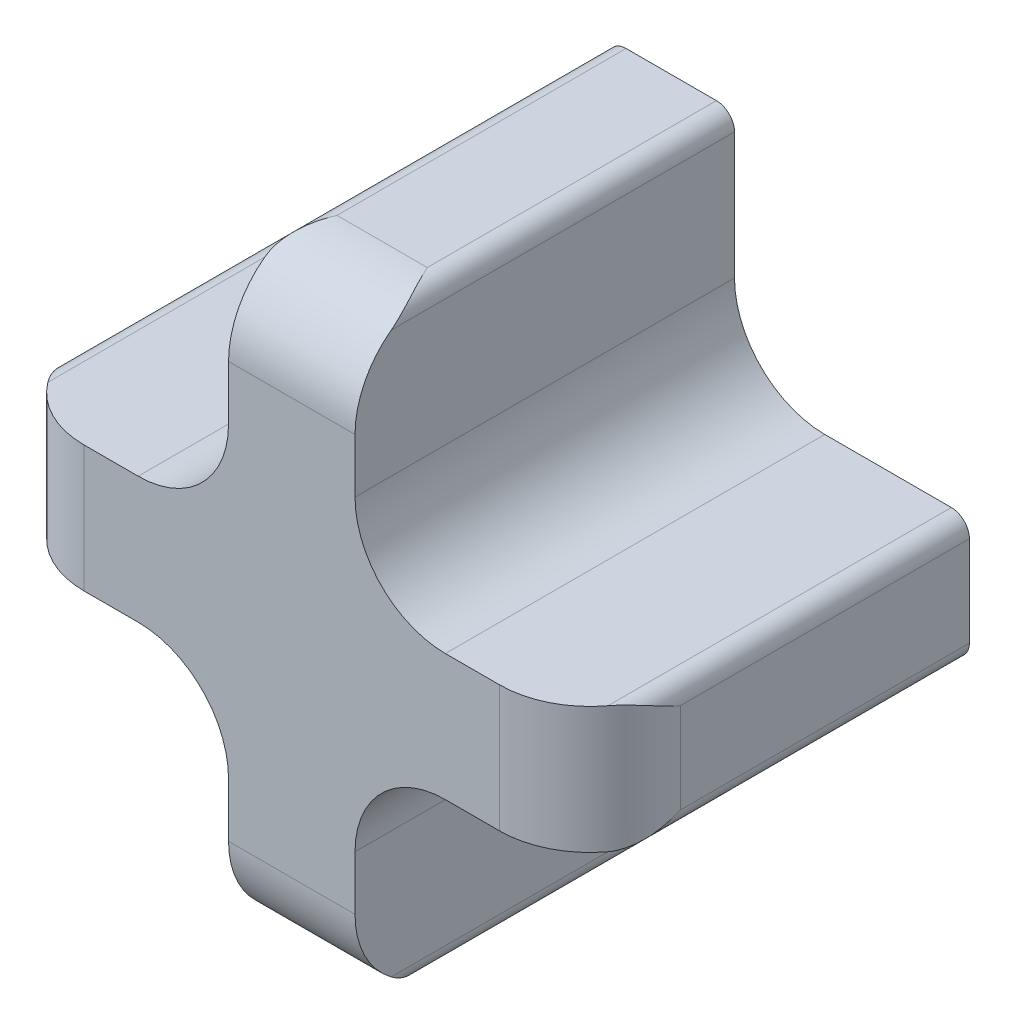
ISO-10303-21;
HEADER;
FILE_DESCRIPTION(('STEP AP214'),'2;1');
FILE_NAME('part.step','',(''),(''),'','','');
FILE_SCHEMA(('AUTOMOTIVE_DESIGN { 1 0 10303 214 1 1 1 1 }'));
ENDSEC;
DATA;
#1=APPLICATION_CONTEXT('core data for automotive mechanical design processes');
#2=APPLICATION_PROTOCOL_DEFINITION('international standard','automotive_design',2000,#1);
#3=PRODUCT_CONTEXT('',#1,'mechanical');
#4=PRODUCT('Part','Part','',(#3));
#5=PRODUCT_RELATED_PRODUCT_CATEGORY('part','',(#4));
#6=PRODUCT_DEFINITION_FORMATION('','',#4);
#7=PRODUCT_DEFINITION_CONTEXT('part definition',#1,'design');
#8=PRODUCT_DEFINITION('design','',#6,#7);
#9=PRODUCT_DEFINITION_SHAPE('','',#8);
#10=(LENGTH_UNIT() NAMED_UNIT(*) SI_UNIT(.MILLI.,.METRE.));
#11=(NAMED_UNIT(*) PLANE_ANGLE_UNIT() SI_UNIT($,.RADIAN.));
#12=(NAMED_UNIT(*) SI_UNIT($,.STERADIAN.) SOLID_ANGLE_UNIT());
#13=UNCERTAINTY_MEASURE_WITH_UNIT(LENGTH_MEASURE(1.E-05),#10,'distance_accuracy_value','');
#14=(GEOMETRIC_REPRESENTATION_CONTEXT(3) GLOBAL_UNCERTAINTY_ASSIGNED_CONTEXT((#13)) GLOBAL_UNIT_ASSIGNED_CONTEXT((#10,
#11,#12)) REPRESENTATION_CONTEXT('',''));
#15=CARTESIAN_POINT('',(0.,0.,0.));
#16=DIRECTION('',(0.,0.,1.));
#17=DIRECTION('',(1.,0.,0.));
#18=AXIS2_PLACEMENT_3D('',#15,#16,#17);
#19=CARTESIAN_POINT('',(-29.8701759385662,-19.8811119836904,2.1));
#20=DIRECTION('',(0.,0.,1.));
#21=DIRECTION('',(1.,0.,0.));
#22=AXIS2_PLACEMENT_3D('',#19,#20,#21);
#23=CYLINDRICAL_SURFACE('',#22,0.0999999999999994);
#24=DIRECTION('',(0.,0.,-1.));
#25=VECTOR('',#24,1.);
#26=CARTESIAN_POINT('',(-29.8701759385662,-19.7811119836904,2.1));
#27=LINE('',#26,#25);
#28=CARTESIAN_POINT('',(-29.8701759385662,-19.7811119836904,1.9));
#29=VERTEX_POINT('',#28);
#30=CARTESIAN_POINT('',(-29.8701759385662,-19.7811119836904,0.));
#31=VERTEX_POINT('',#30);
#32=EDGE_CURVE('E472',#29,#31,#27,.T.);
#33=ORIENTED_EDGE('',*,*,#32,.T.);
#34=CARTESIAN_POINT('',(-29.8701759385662,-19.8811119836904,0.));
#35=DIRECTION('',(0.,0.,1.));
#36=DIRECTION('',(1.,0.,0.));
#37=AXIS2_PLACEMENT_3D('',#34,#35,#36);
#38=CIRCLE('',#37,0.0999999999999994);
#39=CARTESIAN_POINT('',(-29.9701759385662,-19.8811119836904,0.));
#40=VERTEX_POINT('',#39);
#41=EDGE_CURVE('E215',#31,#40,#38,.T.);
#42=ORIENTED_EDGE('',*,*,#41,.T.);
#43=DIRECTION('',(0.,0.,1.));
#44=VECTOR('',#43,1.);
#45=CARTESIAN_POINT('',(-29.9701759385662,-19.8811119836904,2.1));
#46=LINE('',#45,#44);
#47=CARTESIAN_POINT('',(-29.9701759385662,-19.8811119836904,1.6));
#48=VERTEX_POINT('',#47);
#49=EDGE_CURVE('E216',#40,#48,#46,.T.);
#50=ORIENTED_EDGE('',*,*,#49,.T.);
#51=CARTESIAN_POINT('',(-29.8701759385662,-19.7811119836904,1.9));
#52=CARTESIAN_POINT('',(-29.8796560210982,-19.7811611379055,1.88737077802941));
#53=CARTESIAN_POINT('',(-29.8884673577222,-19.7824486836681,1.87436565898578));
#54=CARTESIAN_POINT('',(-29.9046642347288,-19.7868652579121,1.84790514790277));
#55=CARTESIAN_POINT('',(-29.9120593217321,-19.7899813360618,1.83445354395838));
#56=CARTESIAN_POINT('',(-29.929739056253,-19.7998121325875,1.79854636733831));
#57=CARTESIAN_POINT('',(-29.9388644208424,-19.8075548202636,1.77581255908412));
#58=CARTESIAN_POINT('',(-29.9536265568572,-19.8248473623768,1.72985254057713));
#59=CARTESIAN_POINT('',(-29.9592486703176,-19.8344045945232,1.70662467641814));
#60=CARTESIAN_POINT('',(-29.967635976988,-19.8556574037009,1.65696642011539));
#61=CARTESIAN_POINT('',(-29.969943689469,-19.86747012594,1.63050646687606));
#62=CARTESIAN_POINT('',(-29.9701703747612,-19.879894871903,1.60272156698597));
#63=CARTESIAN_POINT('',(-29.9701759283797,-19.8805034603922,1.60136072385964));
#64=CARTESIAN_POINT('',(-29.9701759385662,-19.8811119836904,1.6));
#65=B_SPLINE_CURVE_WITH_KNOTS('',3,(#51,#52,#53,#54,#55,#56,#57,#58,#59,#60,#61,#62,#63,#64),
.UNSPECIFIED.,.F.,.F.,(4,2,2,2,2,2,4),(0.,0.0471658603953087,0.0940016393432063,
0.170666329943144,0.247649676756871,0.334481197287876,0.338953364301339),.UNSPECIFIED.);
#66=EDGE_CURVE('E21',#48,#29,#65,.F.);
#67=ORIENTED_EDGE('',*,*,#66,.T.);
#68=EDGE_LOOP('',(#33,#42,#50,#67));
#69=FACE_BOUND('',#68,.T.);
#70=ADVANCED_FACE('F17',(#69),#23,.T.);
#71=CARTESIAN_POINT('',(-26.6701759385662,-19.7811119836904,2.1));
#72=DIRECTION('',(0.,-1.,0.));
#73=DIRECTION('',(0.,0.,-1.));
#74=AXIS2_PLACEMENT_3D('',#71,#72,#73);
#75=PLANE('',#74);
#76=CARTESIAN_POINT('',(-29.4701759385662,-19.7811119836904,1.6));
#77=DIRECTION('',(0.,-1.,0.));
#78=DIRECTION('',(1.,0.,0.));
#79=AXIS2_PLACEMENT_3D('',#76,#77,#78);
#80=CIRCLE('',#79,0.5);
#81=CARTESIAN_POINT('',(-29.4701759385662,-19.7811119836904,2.1));
#82=VERTEX_POINT('',#81);
#83=EDGE_CURVE('E210',#82,#29,#80,.T.);
#84=ORIENTED_EDGE('',*,*,#83,.F.);
#85=DIRECTION('',(1.,0.,0.));
#86=VECTOR('',#85,1.);
#87=CARTESIAN_POINT('',(-26.6701759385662,-19.7811119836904,2.1));
#88=LINE('',#87,#86);
#89=CARTESIAN_POINT('',(-29.1701759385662,-19.7811119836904,2.1));
#90=VERTEX_POINT('',#89);
#91=EDGE_CURVE('E473',#90,#82,#88,.F.);
#92=ORIENTED_EDGE('',*,*,#91,.F.);
#93=DIRECTION('',(0.,0.,1.));
#94=VECTOR('',#93,1.);
#95=CARTESIAN_POINT('',(-29.1701759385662,-19.7811119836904,2.1));
#96=LINE('',#95,#94);
#97=CARTESIAN_POINT('',(-29.1701759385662,-19.7811119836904,0.));
#98=VERTEX_POINT('',#97);
#99=EDGE_CURVE('E468',#90,#98,#96,.F.);
#100=ORIENTED_EDGE('',*,*,#99,.T.);
#101=DIRECTION('',(1.,0.,0.));
#102=VECTOR('',#101,1.);
#103=CARTESIAN_POINT('',(-26.6701759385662,-19.7811119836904,0.));
#104=LINE('',#103,#102);
#105=EDGE_CURVE('E228',#31,#98,#104,.T.);
#106=ORIENTED_EDGE('',*,*,#105,.F.);
#107=ORIENTED_EDGE('',*,*,#32,.F.);
#108=EDGE_LOOP('',(#84,#92,#100,#106,#107));
#109=FACE_BOUND('',#108,.T.);
#110=ADVANCED_FACE('F311',(#109),#75,.F.);
#111=CARTESIAN_POINT('',(-29.1701759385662,-19.2811119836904,2.1));
#112=DIRECTION('',(0.,0.,1.));
#113=DIRECTION('',(1.,0.,0.));
#114=AXIS2_PLACEMENT_3D('',#111,#112,#113);
#115=CYLINDRICAL_SURFACE('',#114,0.5);
#116=ORIENTED_EDGE('',*,*,#99,.F.);
#117=CARTESIAN_POINT('',(-29.1701759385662,-19.2811119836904,2.1));
#118=DIRECTION('',(0.,0.,1.));
#119=DIRECTION('',(1.,0.,0.));
#120=AXIS2_PLACEMENT_3D('',#117,#118,#119);
#121=CIRCLE('',#120,0.5);
#122=CARTESIAN_POINT('',(-28.6701759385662,-19.2811119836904,2.1));
#123=VERTEX_POINT('',#122);
#124=EDGE_CURVE('E471',#123,#90,#121,.F.);
#125=ORIENTED_EDGE('',*,*,#124,.F.);
#126=DIRECTION('',(0.,0.,1.));
#127=VECTOR('',#126,1.);
#128=CARTESIAN_POINT('',(-28.6701759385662,-19.2811119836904,2.1));
#129=LINE('',#128,#127);
#130=CARTESIAN_POINT('',(-28.6701759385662,-19.2811119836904,0.));
#131=VERTEX_POINT('',#130);
#132=EDGE_CURVE('E455',#131,#123,#129,.T.);
#133=ORIENTED_EDGE('',*,*,#132,.F.);
#134=CARTESIAN_POINT('',(-29.1701759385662,-19.2811119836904,0.));
#135=DIRECTION('',(0.,0.,1.));
#136=DIRECTION('',(1.,0.,0.));
#137=AXIS2_PLACEMENT_3D('',#134,#135,#136);
#138=CIRCLE('',#137,0.5);
#139=EDGE_CURVE('E462',#98,#131,#138,.T.);
#140=ORIENTED_EDGE('',*,*,#139,.F.);
#141=EDGE_LOOP('',(#116,#125,#133,#140));
#142=FACE_BOUND('',#141,.T.);
#143=ADVANCED_FACE('F308',(#142),#115,.F.);
#144=CARTESIAN_POINT('',(-28.6701759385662,-21.7811119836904,2.1));
#145=DIRECTION('',(-1.,0.,0.));
#146=DIRECTION('',(0.,0.,1.));
#147=AXIS2_PLACEMENT_3D('',#144,#145,#146);
#148=PLANE('',#147);
#149=DIRECTION('',(0.,1.,0.));
#150=VECTOR('',#149,1.);
#151=CARTESIAN_POINT('',(-28.6701759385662,-21.7811119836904,0.));
#152=LINE('',#151,#150);
#153=CARTESIAN_POINT('',(-28.6701759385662,-18.5811119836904,0.));
#154=VERTEX_POINT('',#153);
#155=EDGE_CURVE('E463',#154,#131,#152,.F.);
#156=ORIENTED_EDGE('',*,*,#155,.T.);
#157=ORIENTED_EDGE('',*,*,#132,.T.);
#158=DIRECTION('',(0.,1.,0.));
#159=VECTOR('',#158,1.);
#160=CARTESIAN_POINT('',(-28.6701759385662,-21.7811119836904,2.1));
#161=LINE('',#160,#159);
#162=CARTESIAN_POINT('',(-28.6701759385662,-18.9811119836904,2.1));
#163=VERTEX_POINT('',#162);
#164=EDGE_CURVE('E458',#123,#163,#161,.T.);
#165=ORIENTED_EDGE('',*,*,#164,.T.);
#166=CARTESIAN_POINT('',(-28.6701759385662,-18.9811119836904,1.6));
#167=DIRECTION('',(-1.,0.,0.));
#168=DIRECTION('',(0.,0.,1.));
#169=AXIS2_PLACEMENT_3D('',#166,#167,#168);
#170=CIRCLE('',#169,0.5);
#171=CARTESIAN_POINT('',(-28.6701759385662,-18.5811119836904,1.9));
#172=VERTEX_POINT('',#171);
#173=EDGE_CURVE('E461',#163,#172,#170,.T.);
#174=ORIENTED_EDGE('',*,*,#173,.T.);
#175=DIRECTION('',(0.,0.,1.));
#176=VECTOR('',#175,1.);
#177=CARTESIAN_POINT('',(-28.6701759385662,-18.5811119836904,2.1));
#178=LINE('',#177,#176);
#179=EDGE_CURVE('E452',#154,#172,#178,.T.);
#180=ORIENTED_EDGE('',*,*,#179,.F.);
#181=EDGE_LOOP('',(#156,#157,#165,#174,#180));
#182=FACE_BOUND('',#181,.T.);
#183=ADVANCED_FACE('F304',(#182),#148,.T.);
#184=CARTESIAN_POINT('',(-28.5701759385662,-18.5811119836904,2.1));
#185=DIRECTION('',(0.,0.,1.));
#186=DIRECTION('',(1.,0.,0.));
#187=AXIS2_PLACEMENT_3D('',#184,#185,#186);
#188=CYLINDRICAL_SURFACE('',#187,0.0999999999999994);
#189=DIRECTION('',(0.,0.,-1.));
#190=VECTOR('',#189,1.);
#191=CARTESIAN_POINT('',(-28.5701759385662,-18.4811119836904,2.1));
#192=LINE('',#191,#190);
#193=CARTESIAN_POINT('',(-28.5701759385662,-18.4811119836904,1.6));
#194=VERTEX_POINT('',#193);
#195=CARTESIAN_POINT('',(-28.5701759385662,-18.4811119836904,0.));
#196=VERTEX_POINT('',#195);
#197=EDGE_CURVE('E445',#194,#196,#192,.T.);
#198=ORIENTED_EDGE('',*,*,#197,.T.);
#199=CARTESIAN_POINT('',(-28.5701759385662,-18.5811119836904,0.));
#200=DIRECTION('',(0.,0.,1.));
#201=DIRECTION('',(1.,0.,0.));
#202=AXIS2_PLACEMENT_3D('',#199,#200,#201);
#203=CIRCLE('',#202,0.0999999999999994);
#204=EDGE_CURVE('E288',#196,#154,#203,.T.);
#205=ORIENTED_EDGE('',*,*,#204,.T.);
#206=ORIENTED_EDGE('',*,*,#179,.T.);
#207=CARTESIAN_POINT('',(-28.6701759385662,-18.5811119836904,1.9));
#208=CARTESIAN_POINT('',(-28.6701267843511,-18.5716319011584,1.88737077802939));
#209=CARTESIAN_POINT('',(-28.6688392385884,-18.5628205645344,1.87436565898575));
#210=CARTESIAN_POINT('',(-28.6644226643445,-18.5466236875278,1.84790514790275));
#211=CARTESIAN_POINT('',(-28.6613065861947,-18.5392286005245,1.83445354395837));
#212=CARTESIAN_POINT('',(-28.6514757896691,-18.5215488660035,1.79854636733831));
#213=CARTESIAN_POINT('',(-28.6437331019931,-18.5124235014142,1.7758125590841));
#214=CARTESIAN_POINT('',(-28.6264405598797,-18.4976613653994,1.72985254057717));
#215=CARTESIAN_POINT('',(-28.6168833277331,-18.492039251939,1.70662467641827));
#216=CARTESIAN_POINT('',(-28.595630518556,-18.4836519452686,1.65696642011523));
#217=CARTESIAN_POINT('',(-28.5838177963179,-18.4813442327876,1.63050646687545));
#218=CARTESIAN_POINT('',(-28.5713930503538,-18.4811175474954,1.60272156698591));
#219=CARTESIAN_POINT('',(-28.5707844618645,-18.4811119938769,1.60136072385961));
#220=CARTESIAN_POINT('',(-28.5701759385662,-18.4811119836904,1.6));
#221=B_SPLINE_CURVE_WITH_KNOTS('',3,(#207,#208,#209,#210,#211,#212,#213,#214,#215,#216,#217,
#218,#219,#220),.UNSPECIFIED.,.F.,.F.,(4,2,2,2,2,2,4),(0.,0.047165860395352,0.0940016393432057,
0.17066632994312,0.247649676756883,0.334481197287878,0.338953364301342),.UNSPECIFIED.);
#222=EDGE_CURVE('E270',#172,#194,#221,.T.);
#223=ORIENTED_EDGE('',*,*,#222,.T.);
#224=EDGE_LOOP('',(#198,#205,#206,#223));
#225=FACE_BOUND('',#224,.T.);
#226=ADVANCED_FACE('F299',(#225),#188,.T.);
#227=CARTESIAN_POINT('',(-27.9701759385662,-18.4811119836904,2.1));
#228=DIRECTION('',(0.,-1.,0.));
#229=DIRECTION('',(0.,0.,-1.));
#230=AXIS2_PLACEMENT_3D('',#227,#228,#229);
#231=PLANE('',#230);
#232=DIRECTION('',(1.,0.,0.));
#233=VECTOR('',#232,1.);
#234=CARTESIAN_POINT('',(-27.9701759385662,-18.4811119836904,1.6));
#235=LINE('',#234,#233);
#236=CARTESIAN_POINT('',(-28.0701759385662,-18.4811119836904,1.6));
#237=VERTEX_POINT('',#236);
#238=EDGE_CURVE('E450',#237,#194,#235,.F.);
#239=ORIENTED_EDGE('',*,*,#238,.F.);
#240=DIRECTION('',(0.,0.,-1.));
#241=VECTOR('',#240,1.);
#242=CARTESIAN_POINT('',(-28.0701759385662,-18.4811119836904,2.1));
#243=LINE('',#242,#241);
#244=CARTESIAN_POINT('',(-28.0701759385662,-18.4811119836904,0.));
#245=VERTEX_POINT('',#244);
#246=EDGE_CURVE('E286',#245,#237,#243,.F.);
#247=ORIENTED_EDGE('',*,*,#246,.F.);
#248=DIRECTION('',(1.,0.,0.));
#249=VECTOR('',#248,1.);
#250=CARTESIAN_POINT('',(-27.9701759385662,-18.4811119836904,0.));
#251=LINE('',#250,#249);
#252=EDGE_CURVE('E448',#196,#245,#251,.T.);
#253=ORIENTED_EDGE('',*,*,#252,.F.);
#254=ORIENTED_EDGE('',*,*,#197,.F.);
#255=EDGE_LOOP('',(#239,#247,#253,#254));
#256=FACE_BOUND('',#255,.T.);
#257=ADVANCED_FACE('F295',(#256),#231,.F.);
#258=CARTESIAN_POINT('',(-28.0701759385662,-18.5811119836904,2.1));
#259=DIRECTION('',(0.,0.,-1.));
#260=DIRECTION('',(-1.,0.,0.));
#261=AXIS2_PLACEMENT_3D('',#258,#259,#260);
#262=CYLINDRICAL_SURFACE('',#261,0.0999999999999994);
#263=DIRECTION('',(0.,0.,1.));
#264=VECTOR('',#263,1.);
#265=CARTESIAN_POINT('',(-27.9701759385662,-18.5811119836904,2.1));
#266=LINE('',#265,#264);
#267=CARTESIAN_POINT('',(-27.9701759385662,-18.5811119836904,1.9));
#268=VERTEX_POINT('',#267);
#269=CARTESIAN_POINT('',(-27.9701759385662,-18.5811119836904,0.));
#270=VERTEX_POINT('',#269);
#271=EDGE_CURVE('E435',#268,#270,#266,.F.);
#272=ORIENTED_EDGE('',*,*,#271,.T.);
#273=CARTESIAN_POINT('',(-28.0701759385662,-18.5811119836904,0.));
#274=DIRECTION('',(0.,0.,-1.));
#275=DIRECTION('',(-1.,0.,0.));
#276=AXIS2_PLACEMENT_3D('',#273,#274,#275);
#277=CIRCLE('',#276,0.0999999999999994);
#278=EDGE_CURVE('E285',#270,#245,#277,.F.);
#279=ORIENTED_EDGE('',*,*,#278,.T.);
#280=ORIENTED_EDGE('',*,*,#246,.T.);
#281=CARTESIAN_POINT('',(-28.0701759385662,-18.4811119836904,1.6));
#282=CARTESIAN_POINT('',(-28.0701755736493,-18.4811119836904,1.60000000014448));
#283=CARTESIAN_POINT('',(-28.0701752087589,-18.4811119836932,1.60000006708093));
#284=CARTESIAN_POINT('',(-28.0701745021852,-18.4811119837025,1.60000028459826));
#285=CARTESIAN_POINT('',(-28.0701741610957,-18.481111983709,1.60000043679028));
#286=CARTESIAN_POINT('',(-28.070173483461,-18.4811119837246,1.6000008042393));
#287=CARTESIAN_POINT('',(-28.0701731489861,-18.481111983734,1.60000102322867));
#288=CARTESIAN_POINT('',(-28.0701725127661,-18.4811119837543,1.60000149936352));
#289=CARTESIAN_POINT('',(-28.07017221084,-18.4811119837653,1.60000175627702));
#290=CARTESIAN_POINT('',(-28.0701712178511,-18.4811119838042,1.60000266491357));
#291=CARTESIAN_POINT('',(-28.0701705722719,-18.4811119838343,1.6000033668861));
#292=CARTESIAN_POINT('',(-28.0701694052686,-18.4811119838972,1.6000048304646));
#293=CARTESIAN_POINT('',(-28.0701688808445,-18.48111198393,1.60000558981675));
#294=CARTESIAN_POINT('',(-28.0701669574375,-18.481111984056,1.6000085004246));
#295=CARTESIAN_POINT('',(-28.0701656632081,-18.4811119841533,1.60001072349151));
#296=CARTESIAN_POINT('',(-28.0701635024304,-18.4811119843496,1.60001514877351));
#297=CARTESIAN_POINT('',(-28.0701626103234,-18.4811119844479,1.60001733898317));
#298=CARTESIAN_POINT('',(-28.0701589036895,-18.4811119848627,1.60002651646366));
#299=CARTESIAN_POINT('',(-28.0701561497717,-18.4811119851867,1.60003352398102));
#300=CARTESIAN_POINT('',(-28.0701516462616,-18.4811119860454,1.60004673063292));
#301=CARTESIAN_POINT('',(-28.0701498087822,-18.4811119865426,1.60005289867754));
#302=CARTESIAN_POINT('',(-28.0701354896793,-18.4811119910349,1.60009706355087));
#303=CARTESIAN_POINT('',(-28.0701175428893,-18.4811119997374,1.60013302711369));
#304=CARTESIAN_POINT('',(-28.0700508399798,-18.4811120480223,1.60027187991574));
#305=CARTESIAN_POINT('',(-28.0700061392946,-18.4811121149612,1.60037618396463));
#306=CARTESIAN_POINT('',(-28.0698314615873,-18.4811124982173,1.60077765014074));
#307=CARTESIAN_POINT('',(-28.0696972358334,-18.481113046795,1.60107335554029));
#308=CARTESIAN_POINT('',(-28.0691556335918,-18.4811163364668,1.60227249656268));
#309=CARTESIAN_POINT('',(-28.0687530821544,-18.481121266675,1.60317754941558));
#310=CARTESIAN_POINT('',(-28.0647214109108,-18.4811951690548,1.61223457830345));
#311=CARTESIAN_POINT('',(-28.0610695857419,-18.4814608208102,1.62037880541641));
#312=CARTESIAN_POINT('',(-28.053938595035,-18.4823753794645,1.63638341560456));
#313=CARTESIAN_POINT('',(-28.0504578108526,-18.4830107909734,1.64424392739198));
#314=CARTESIAN_POINT('',(-28.0431693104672,-18.4847473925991,1.66082070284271));
#315=CARTESIAN_POINT('',(-28.0393680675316,-18.4858923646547,1.66953535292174));
#316=CARTESIAN_POINT('',(-28.0318441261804,-18.4886624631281,1.68702031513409));
#317=CARTESIAN_POINT('',(-28.0281224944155,-18.4902919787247,1.69579038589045));
#318=CARTESIAN_POINT('',(-28.0189302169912,-18.4950143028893,1.71787716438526));
#319=CARTESIAN_POINT('',(-28.0135637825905,-18.4984265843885,1.73117079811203));
#320=CARTESIAN_POINT('',(-28.0034902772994,-18.5063246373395,1.75735307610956));
#321=CARTESIAN_POINT('',(-27.9987718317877,-18.510786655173,1.77024439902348));
#322=CARTESIAN_POINT('',(-27.9921715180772,-18.5184438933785,1.78970924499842));
#323=CARTESIAN_POINT('',(-27.9900127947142,-18.5212234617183,1.79635384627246));
#324=CARTESIAN_POINT('',(-27.9859349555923,-18.527108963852,1.80960458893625));
#325=CARTESIAN_POINT('',(-27.9840168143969,-18.530216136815,1.8162104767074));
#326=CARTESIAN_POINT('',(-27.9785516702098,-18.5403047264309,1.83647993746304));
#327=CARTESIAN_POINT('',(-27.9754970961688,-18.5478299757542,1.85001971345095));
#328=CARTESIAN_POINT('',(-27.9712416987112,-18.564254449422,1.87653774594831));
#329=CARTESIAN_POINT('',(-27.9700382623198,-18.573151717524,1.88951676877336));
#330=CARTESIAN_POINT('',(-27.9703355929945,-18.5920423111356,1.91442316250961));
#331=CARTESIAN_POINT('',(-27.9717953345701,-18.6020168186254,1.92636356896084));
#332=CARTESIAN_POINT('',(-27.9766958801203,-18.6169772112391,1.94271938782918));
#333=CARTESIAN_POINT('',(-27.9786614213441,-18.6217809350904,1.94774661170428));
#334=CARTESIAN_POINT('',(-27.9835474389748,-18.631355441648,1.95737379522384));
#335=CARTESIAN_POINT('',(-27.9864685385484,-18.6361262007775,1.96197347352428));
#336=CARTESIAN_POINT('',(-27.9928472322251,-18.644707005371,1.96994694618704));
#337=CARTESIAN_POINT('',(-27.9961555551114,-18.6485527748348,1.97340077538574));
#338=CARTESIAN_POINT('',(-28.0035691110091,-18.6558822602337,1.97980153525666));
#339=CARTESIAN_POINT('',(-28.0076732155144,-18.6593664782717,1.98274917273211));
#340=CARTESIAN_POINT('',(-28.0158714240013,-18.6652058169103,1.987575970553));
#341=CARTESIAN_POINT('',(-28.0198435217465,-18.6676519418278,1.9895517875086));
#342=CARTESIAN_POINT('',(-28.0282563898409,-18.6720250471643,1.99303064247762));
#343=CARTESIAN_POINT('',(-28.0326970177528,-18.6739521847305,1.99453382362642));
#344=CARTESIAN_POINT('',(-28.0419670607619,-18.6771768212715,1.99702346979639));
#345=CARTESIAN_POINT('',(-28.0467983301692,-18.6784710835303,1.9980072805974));
#346=CARTESIAN_POINT('',(-28.0566796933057,-18.6803242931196,1.99940975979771));
#347=CARTESIAN_POINT('',(-28.06172970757,-18.6808835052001,1.99982863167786));
#348=CARTESIAN_POINT('',(-28.0714056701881,-18.6812107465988,2.0000740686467));
#349=CARTESIAN_POINT('',(-28.0760282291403,-18.6810463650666,1.99995123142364));
#350=CARTESIAN_POINT('',(-28.0851687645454,-18.6800883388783,1.9992306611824));
#351=CARTESIAN_POINT('',(-28.0896867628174,-18.6792948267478,1.99863302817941));
#352=CARTESIAN_POINT('',(-28.0984181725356,-18.6771446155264,1.99699572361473));
#353=CARTESIAN_POINT('',(-28.1026354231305,-18.6757975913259,1.99596363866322));
#354=CARTESIAN_POINT('',(-28.1107510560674,-18.672614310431,1.9934885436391));
#355=CARTESIAN_POINT('',(-28.1146493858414,-18.6707779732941,1.9920454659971));
#356=CARTESIAN_POINT('',(-28.1223223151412,-18.6665593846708,1.98867007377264));
#357=CARTESIAN_POINT('',(-28.1260685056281,-18.6641476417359,1.9867103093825));
#358=CARTESIAN_POINT('',(-28.1330717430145,-18.6589779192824,1.9824146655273));
#359=CARTESIAN_POINT('',(-28.1363285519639,-18.6562197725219,1.98007860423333));
#360=CARTESIAN_POINT('',(-28.1436353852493,-18.6492231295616,1.97400440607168));
#361=CARTESIAN_POINT('',(-28.1474234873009,-18.6448584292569,1.97009556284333));
#362=CARTESIAN_POINT('',(-28.1540204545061,-18.6358954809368,1.96175043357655));
#363=CARTESIAN_POINT('',(-28.1568269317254,-18.6312966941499,1.95731289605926));
#364=CARTESIAN_POINT('',(-28.1625009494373,-18.6202128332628,1.94617239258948));
#365=CARTESIAN_POINT('',(-28.1649440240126,-18.6137089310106,1.93927317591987));
#366=CARTESIAN_POINT('',(-28.1684067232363,-18.6009691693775,1.92493701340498));
#367=CARTESIAN_POINT('',(-28.1694274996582,-18.5947330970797,1.91750050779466));
#368=CARTESIAN_POINT('',(-28.170591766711,-18.5794676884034,1.89816633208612));
#369=CARTESIAN_POINT('',(-28.1699781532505,-18.5707201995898,1.88600264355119));
#370=CARTESIAN_POINT('',(-28.1668901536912,-18.5543378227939,1.86094642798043));
#371=CARTESIAN_POINT('',(-28.1643865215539,-18.5467226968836,1.84804542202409));
#372=CARTESIAN_POINT('',(-28.1560208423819,-18.5282961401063,1.81342780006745));
#373=CARTESIAN_POINT('',(-28.1490342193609,-18.5185897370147,1.79139055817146));
#374=CARTESIAN_POINT('',(-28.137347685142,-18.5068439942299,1.75872396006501));
#375=CARTESIAN_POINT('',(-28.1334036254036,-18.5034703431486,1.74825098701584));
#376=CARTESIAN_POINT('',(-28.1252122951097,-18.497466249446,1.72729681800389));
#377=CARTESIAN_POINT('',(-28.1209673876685,-18.4948306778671,1.71681621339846));
#378=CARTESIAN_POINT('',(-28.1135654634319,-18.4909502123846,1.69898337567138));
#379=CARTESIAN_POINT('',(-28.1104679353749,-18.4895258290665,1.69164415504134));
#380=CARTESIAN_POINT('',(-28.1041127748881,-18.4869830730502,1.67677745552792));
#381=CARTESIAN_POINT('',(-28.1008531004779,-18.4858724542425,1.669249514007));
#382=CARTESIAN_POINT('',(-28.0931858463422,-18.4836885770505,1.65169081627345));
#383=CARTESIAN_POINT('',(-28.0887544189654,-18.4827485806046,1.6416538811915));
#384=CARTESIAN_POINT('',(-28.0802031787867,-18.4815312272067,1.62244133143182));
#385=CARTESIAN_POINT('',(-28.0760895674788,-18.4812035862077,1.61326630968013));
#386=CARTESIAN_POINT('',(-28.0715997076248,-18.4811212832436,1.60317956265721));
#387=CARTESIAN_POINT('',(-28.0711980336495,-18.4811163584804,1.60227653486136));
#388=CARTESIAN_POINT('',(-28.0706566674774,-18.4811130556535,1.6010778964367));
#389=CARTESIAN_POINT('',(-28.0705217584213,-18.4811125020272,1.60078068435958));
#390=CARTESIAN_POINT('',(-28.0703462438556,-18.4811121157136,1.60037729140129));
#391=CARTESIAN_POINT('',(-28.0703013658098,-18.4811120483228,1.60027257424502));
#392=CARTESIAN_POINT('',(-28.0702344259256,-18.4811119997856,1.60013323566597));
#393=CARTESIAN_POINT('',(-28.0702164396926,-18.481111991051,1.60009719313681));
#394=CARTESIAN_POINT('',(-28.0702020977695,-18.4811119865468,1.60005293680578));
#395=CARTESIAN_POINT('',(-28.0702002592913,-18.4811119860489,1.60004676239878));
#396=CARTESIAN_POINT('',(-28.0701957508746,-18.4811119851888,1.60003354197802));
#397=CARTESIAN_POINT('',(-28.0701929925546,-18.4811119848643,1.60002652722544));
#398=CARTESIAN_POINT('',(-28.070189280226,-18.4811119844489,1.6000173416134));
#399=CARTESIAN_POINT('',(-28.0701883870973,-18.4811119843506,1.6000151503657));
#400=CARTESIAN_POINT('',(-28.0701862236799,-18.481111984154,1.60001072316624));
#401=CARTESIAN_POINT('',(-28.0701849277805,-18.4811119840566,1.60000849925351));
#402=CARTESIAN_POINT('',(-28.0701830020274,-18.4811119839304,1.60000558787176));
#403=CARTESIAN_POINT('',(-28.0701824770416,-18.4811119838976,1.60000482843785));
#404=CARTESIAN_POINT('',(-28.0701813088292,-18.4811119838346,1.60000336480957));
#405=CARTESIAN_POINT('',(-28.0701806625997,-18.4811119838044,1.60000266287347));
#406=CARTESIAN_POINT('',(-28.0701796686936,-18.4811119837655,1.60000175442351));
#407=CARTESIAN_POINT('',(-28.0701793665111,-18.4811119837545,1.60000149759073));
#408=CARTESIAN_POINT('',(-28.0701787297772,-18.4811119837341,1.60000102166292));
#409=CARTESIAN_POINT('',(-28.0701783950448,-18.4811119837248,1.60000080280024));
#410=CARTESIAN_POINT('',(-28.0701777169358,-18.481111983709,1.60000043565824));
#411=CARTESIAN_POINT('',(-28.070177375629,-18.4811119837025,1.60000028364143));
#412=CARTESIAN_POINT('',(-28.0701766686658,-18.4811119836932,1.60000006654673));
#413=CARTESIAN_POINT('',(-28.0701763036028,-18.4811119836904,1.59999999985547));
#414=CARTESIAN_POINT('',(-28.0701759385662,-18.4811119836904,1.6));
#415=B_SPLINE_CURVE_WITH_KNOTS('',3,(#281,#282,#283,#284,#285,#286,#287,#288,#289,#290,#291,
#292,#293,#294,#295,#296,#297,#298,#299,#300,#301,#302,#303,#304,#305,#306,#307,#308,#309,#310,
#311,#312,#313,#314,#315,#316,#317,#318,#319,#320,#321,#322,#323,#324,#325,#326,#327,#328,#329,
#330,#331,#332,#333,#334,#335,#336,#337,#338,#339,#340,#341,#342,#343,#344,#345,#346,#347,#348,
#349,#350,#351,#352,#353,#354,#355,#356,#357,#358,#359,#360,#361,#362,#363,#364,#365,#366,#367,
#368,#369,#370,#371,#372,#373,#374,#375,#376,#377,#378,#379,#380,#381,#382,#383,#384,#385,#386,
#387,#388,#389,#390,#391,#392,#393,#394,#395,#396,#397,#398,#399,#400,#401,#402,#403,#404,#405,
#406,#407,#408,#409,#410,#411,#412,#413,#414),.UNSPECIFIED.,.T.,.F.,(4,2,2,2,2,2,2,2,2,2,2,2,2,
2,2,2,2,2,2,2,2,2,2,2,2,2,2,2,2,2,2,2,2,2,2,2,2,2,2,2,2,2,2,2,2,2,2,2,2,2,2,2,2,2,2,2,2,2,2,2,2,
2,2,2,2,2,4),(0.,1.09372736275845E-06,2.20885724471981E-06,3.40375338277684E-06,
4.5916220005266E-06,7.43859284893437E-06,1.02048802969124E-05,1.78948339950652E-05,
2.49824587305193E-05,4.75636342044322E-05,6.6852677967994E-05,0.000186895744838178,
0.000527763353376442,0.00150145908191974,0.00447368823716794,0.0312482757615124,
0.057102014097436,0.0858183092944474,0.114803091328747,0.158960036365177,0.202200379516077,
0.224747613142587,0.247383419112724,0.294593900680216,0.341737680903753,0.388161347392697,
0.409780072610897,0.431412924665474,0.449754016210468,0.468069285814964,0.483204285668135,
0.498334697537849,0.513541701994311,0.528743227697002,0.54255651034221,0.556366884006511,
0.569945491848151,0.583526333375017,0.598070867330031,0.61262245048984,0.633437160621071,
0.654302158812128,0.683511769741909,0.712697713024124,0.757432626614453,0.802874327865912,
0.877616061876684,0.912667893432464,0.947469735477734,0.971740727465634,0.996567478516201,
1.02958662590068,1.0597496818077,1.06271528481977,1.06369393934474,1.06403615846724,
1.06415646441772,1.06417577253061,1.0641983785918,1.06420547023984,1.06421316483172,
1.06421593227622,1.06421878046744,1.064219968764,1.0642211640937,1.06422227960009,
1.06422337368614),.UNSPECIFIED.);
#416=EDGE_CURVE('E278',#237,#268,#415,.T.);
#417=ORIENTED_EDGE('',*,*,#416,.T.);
#418=EDGE_LOOP('',(#272,#279,#280,#417));
#419=FACE_BOUND('',#418,.T.);
#420=ADVANCED_FACE('F289',(#419),#262,.T.);
#421=CARTESIAN_POINT('',(-27.9701759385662,-21.7811119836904,2.1));
#422=DIRECTION('',(-1.,0.,0.));
#423=DIRECTION('',(0.,0.,1.));
#424=AXIS2_PLACEMENT_3D('',#421,#422,#423);
#425=PLANE('',#424);
#426=CARTESIAN_POINT('',(-27.9701759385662,-18.9811119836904,1.6));
#427=DIRECTION('',(-1.,0.,0.));
#428=DIRECTION('',(0.,0.,1.));
#429=AXIS2_PLACEMENT_3D('',#426,#427,#428);
#430=CIRCLE('',#429,0.5);
#431=CARTESIAN_POINT('',(-27.9701759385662,-18.9811119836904,2.1));
#432=VERTEX_POINT('',#431);
#433=EDGE_CURVE('E438',#432,#268,#430,.T.);
#434=ORIENTED_EDGE('',*,*,#433,.F.);
#435=DIRECTION('',(0.,1.,0.));
#436=VECTOR('',#435,1.);
#437=CARTESIAN_POINT('',(-27.9701759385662,-21.7811119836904,2.1));
#438=LINE('',#437,#436);
#439=CARTESIAN_POINT('',(-27.9701759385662,-19.2811119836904,2.1));
#440=VERTEX_POINT('',#439);
#441=EDGE_CURVE('E439',#440,#432,#438,.T.);
#442=ORIENTED_EDGE('',*,*,#441,.F.);
#443=DIRECTION('',(0.,0.,-1.));
#444=VECTOR('',#443,1.);
#445=CARTESIAN_POINT('',(-27.9701759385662,-19.2811119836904,2.1));
#446=LINE('',#445,#444);
#447=CARTESIAN_POINT('',(-27.9701759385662,-19.2811119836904,0.));
#448=VERTEX_POINT('',#447);
#449=EDGE_CURVE('E431',#440,#448,#446,.T.);
#450=ORIENTED_EDGE('',*,*,#449,.T.);
#451=DIRECTION('',(0.,1.,0.));
#452=VECTOR('',#451,1.);
#453=CARTESIAN_POINT('',(-27.9701759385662,-21.7811119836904,0.));
#454=LINE('',#453,#452);
#455=EDGE_CURVE('E441',#270,#448,#454,.F.);
#456=ORIENTED_EDGE('',*,*,#455,.F.);
#457=ORIENTED_EDGE('',*,*,#271,.F.);
#458=EDGE_LOOP('',(#434,#442,#450,#456,#457));
#459=FACE_BOUND('',#458,.T.);
#460=ADVANCED_FACE('F294',(#459),#425,.F.);
#461=CARTESIAN_POINT('',(-27.4701759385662,-19.2811119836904,2.1));
#462=DIRECTION('',(0.,0.,-1.));
#463=DIRECTION('',(-1.,0.,0.));
#464=AXIS2_PLACEMENT_3D('',#461,#462,#463);
#465=CYLINDRICAL_SURFACE('',#464,0.5);
#466=ORIENTED_EDGE('',*,*,#449,.F.);
#467=CARTESIAN_POINT('',(-27.4701759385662,-19.2811119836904,2.1));
#468=DIRECTION('',(0.,0.,-1.));
#469=DIRECTION('',(-1.,0.,0.));
#470=AXIS2_PLACEMENT_3D('',#467,#468,#469);
#471=CIRCLE('',#470,0.5);
#472=CARTESIAN_POINT('',(-27.4701759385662,-19.7811119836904,2.1));
#473=VERTEX_POINT('',#472);
#474=EDGE_CURVE('E434',#473,#440,#471,.T.);
#475=ORIENTED_EDGE('',*,*,#474,.F.);
#476=DIRECTION('',(0.,0.,-1.));
#477=VECTOR('',#476,1.);
#478=CARTESIAN_POINT('',(-27.4701759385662,-19.7811119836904,2.1));
#479=LINE('',#478,#477);
#480=CARTESIAN_POINT('',(-27.4701759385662,-19.7811119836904,0.));
#481=VERTEX_POINT('',#480);
#482=EDGE_CURVE('E427',#473,#481,#479,.T.);
#483=ORIENTED_EDGE('',*,*,#482,.T.);
#484=CARTESIAN_POINT('',(-27.4701759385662,-19.2811119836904,0.));
#485=DIRECTION('',(0.,0.,-1.));
#486=DIRECTION('',(-1.,0.,0.));
#487=AXIS2_PLACEMENT_3D('',#484,#485,#486);
#488=CIRCLE('',#487,0.5);
#489=EDGE_CURVE('E430',#448,#481,#488,.F.);
#490=ORIENTED_EDGE('',*,*,#489,.F.);
#491=EDGE_LOOP('',(#466,#475,#483,#490));
#492=FACE_BOUND('',#491,.T.);
#493=ADVANCED_FACE('F561',(#492),#465,.F.);
#494=CARTESIAN_POINT('',(-26.6701759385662,-19.7811119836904,2.1));
#495=DIRECTION('',(0.,-1.,0.));
#496=DIRECTION('',(0.,0.,-1.));
#497=AXIS2_PLACEMENT_3D('',#494,#495,#496);
#498=PLANE('',#497);
#499=CARTESIAN_POINT('',(-27.1701759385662,-19.7811119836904,1.6));
#500=DIRECTION('',(0.,1.,0.));
#501=DIRECTION('',(0.,0.,1.));
#502=AXIS2_PLACEMENT_3D('',#499,#500,#501);
#503=CIRCLE('',#502,0.5);
#504=CARTESIAN_POINT('',(-26.7701759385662,-19.7811119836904,1.9));
#505=VERTEX_POINT('',#504);
#506=CARTESIAN_POINT('',(-27.1701759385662,-19.7811119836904,2.1));
#507=VERTEX_POINT('',#506);
#508=EDGE_CURVE('E424',#505,#507,#503,.F.);
#509=ORIENTED_EDGE('',*,*,#508,.F.);
#510=DIRECTION('',(0.,0.,-1.));
#511=VECTOR('',#510,1.);
#512=CARTESIAN_POINT('',(-26.7701759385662,-19.7811119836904,2.1));
#513=LINE('',#512,#511);
#514=CARTESIAN_POINT('',(-26.7701759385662,-19.7811119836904,0.));
#515=VERTEX_POINT('',#514);
#516=EDGE_CURVE('E415',#515,#505,#513,.F.);
#517=ORIENTED_EDGE('',*,*,#516,.F.);
#518=DIRECTION('',(1.,0.,0.));
#519=VECTOR('',#518,1.);
#520=CARTESIAN_POINT('',(-26.6701759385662,-19.7811119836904,0.));
#521=LINE('',#520,#519);
#522=EDGE_CURVE('E425',#481,#515,#521,.T.);
#523=ORIENTED_EDGE('',*,*,#522,.F.);
#524=ORIENTED_EDGE('',*,*,#482,.F.);
#525=DIRECTION('',(1.,0.,0.));
#526=VECTOR('',#525,1.);
#527=CARTESIAN_POINT('',(-26.6701759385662,-19.7811119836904,2.1));
#528=LINE('',#527,#526);
#529=EDGE_CURVE('E419',#507,#473,#528,.F.);
#530=ORIENTED_EDGE('',*,*,#529,.F.);
#531=EDGE_LOOP('',(#509,#517,#523,#524,#530));
#532=FACE_BOUND('',#531,.T.);
#533=ADVANCED_FACE('F541',(#532),#498,.F.);
#534=CARTESIAN_POINT('',(-26.7701759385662,-19.8811119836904,2.1));
#535=DIRECTION('',(0.,0.,-1.));
#536=DIRECTION('',(-1.,0.,0.));
#537=AXIS2_PLACEMENT_3D('',#534,#535,#536);
#538=CYLINDRICAL_SURFACE('',#537,0.0999999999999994);
#539=DIRECTION('',(0.,0.,1.));
#540=VECTOR('',#539,1.);
#541=CARTESIAN_POINT('',(-26.6701759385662,-19.8811119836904,2.1));
#542=LINE('',#541,#540);
#543=CARTESIAN_POINT('',(-26.6701759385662,-19.8811119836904,1.6));
#544=VERTEX_POINT('',#543);
#545=CARTESIAN_POINT('',(-26.6701759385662,-19.8811119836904,0.));
#546=VERTEX_POINT('',#545);
#547=EDGE_CURVE('E409',#544,#546,#542,.F.);
#548=ORIENTED_EDGE('',*,*,#547,.T.);
#549=CARTESIAN_POINT('',(-26.7701759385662,-19.8811119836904,0.));
#550=DIRECTION('',(0.,0.,-1.));
#551=DIRECTION('',(-1.,0.,0.));
#552=AXIS2_PLACEMENT_3D('',#549,#550,#551);
#553=CIRCLE('',#552,0.0999999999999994);
#554=EDGE_CURVE('E413',#546,#515,#553,.F.);
#555=ORIENTED_EDGE('',*,*,#554,.T.);
#556=ORIENTED_EDGE('',*,*,#516,.T.);
#557=CARTESIAN_POINT('',(-26.7701759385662,-19.7811119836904,1.9));
#558=CARTESIAN_POINT('',(-26.7606958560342,-19.7811611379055,1.88737077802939));
#559=CARTESIAN_POINT('',(-26.7518845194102,-19.7824486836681,1.87436565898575));
#560=CARTESIAN_POINT('',(-26.7356876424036,-19.7868652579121,1.84790514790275));
#561=CARTESIAN_POINT('',(-26.7282925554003,-19.7899813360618,1.83445354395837));
#562=CARTESIAN_POINT('',(-26.7106128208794,-19.7998121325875,1.79854636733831));
#563=CARTESIAN_POINT('',(-26.70148745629,-19.8075548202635,1.7758125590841));
#564=CARTESIAN_POINT('',(-26.6867253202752,-19.8248473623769,1.72985254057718));
#565=CARTESIAN_POINT('',(-26.6811032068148,-19.8344045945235,1.70662467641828));
#566=CARTESIAN_POINT('',(-26.6727159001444,-19.8556574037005,1.65696642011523));
#567=CARTESIAN_POINT('',(-26.6704081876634,-19.8674701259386,1.63050646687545));
#568=CARTESIAN_POINT('',(-26.6701815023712,-19.8798948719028,1.60272156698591));
#569=CARTESIAN_POINT('',(-26.6701759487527,-19.8805034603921,1.60136072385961));
#570=CARTESIAN_POINT('',(-26.6701759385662,-19.8811119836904,1.6));
#571=B_SPLINE_CURVE_WITH_KNOTS('',3,(#557,#558,#559,#560,#561,#562,#563,#564,#565,#566,#567,
#568,#569,#570),.UNSPECIFIED.,.F.,.F.,(4,2,2,2,2,2,4),(0.,0.0471658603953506,0.0940016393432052,
0.170666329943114,0.24764967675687,0.334481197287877,0.33895336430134),.UNSPECIFIED.);
#572=EDGE_CURVE('E418',#505,#544,#571,.T.);
#573=ORIENTED_EDGE('',*,*,#572,.T.);
#574=EDGE_LOOP('',(#548,#555,#556,#573));
#575=FACE_BOUND('',#574,.T.);
#576=ADVANCED_FACE('F510',(#575),#538,.T.);
#577=CARTESIAN_POINT('',(-26.6701759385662,-20.4811119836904,2.1));
#578=DIRECTION('',(-1.,0.,0.));
#579=DIRECTION('',(0.,0.,1.));
#580=AXIS2_PLACEMENT_3D('',#577,#578,#579);
#581=PLANE('',#580);
#582=DIRECTION('',(0.,1.,0.));
#583=VECTOR('',#582,1.);
#584=CARTESIAN_POINT('',(-26.6701759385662,-20.4811119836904,1.6));
#585=LINE('',#584,#583);
#586=CARTESIAN_POINT('',(-26.6701759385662,-20.3811119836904,1.6));
#587=VERTEX_POINT('',#586);
#588=EDGE_CURVE('E412',#587,#544,#585,.T.);
#589=ORIENTED_EDGE('',*,*,#588,.F.);
#590=DIRECTION('',(0.,0.,1.));
#591=VECTOR('',#590,1.);
#592=CARTESIAN_POINT('',(-26.6701759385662,-20.3811119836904,2.1));
#593=LINE('',#592,#591);
#594=CARTESIAN_POINT('',(-26.6701759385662,-20.3811119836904,0.));
#595=VERTEX_POINT('',#594);
#596=EDGE_CURVE('E405',#595,#587,#593,.T.);
#597=ORIENTED_EDGE('',*,*,#596,.F.);
#598=DIRECTION('',(0.,1.,0.));
#599=VECTOR('',#598,1.);
#600=CARTESIAN_POINT('',(-26.6701759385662,-20.4811119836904,0.));
#601=LINE('',#600,#599);
#602=EDGE_CURVE('E410',#546,#595,#601,.F.);
#603=ORIENTED_EDGE('',*,*,#602,.F.);
#604=ORIENTED_EDGE('',*,*,#547,.F.);
#605=EDGE_LOOP('',(#589,#597,#603,#604));
#606=FACE_BOUND('',#605,.T.);
#607=ADVANCED_FACE('F533',(#606),#581,.F.);
#608=CARTESIAN_POINT('',(-26.7701759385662,-20.3811119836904,2.1));
#609=DIRECTION('',(0.,0.,1.));
#610=DIRECTION('',(1.,0.,0.));
#611=AXIS2_PLACEMENT_3D('',#608,#609,#610);
#612=CYLINDRICAL_SURFACE('',#611,0.0999999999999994);
#613=DIRECTION('',(0.,0.,-1.));
#614=VECTOR('',#613,1.);
#615=CARTESIAN_POINT('',(-26.7701759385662,-20.4811119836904,2.1));
#616=LINE('',#615,#614);
#617=CARTESIAN_POINT('',(-26.7701759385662,-20.4811119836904,0.));
#618=VERTEX_POINT('',#617);
#619=CARTESIAN_POINT('',(-26.7701759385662,-20.4811119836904,1.9));
#620=VERTEX_POINT('',#619);
#621=EDGE_CURVE('E397',#618,#620,#616,.F.);
#622=ORIENTED_EDGE('',*,*,#621,.F.);
#623=CARTESIAN_POINT('',(-26.7701759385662,-20.3811119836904,0.));
#624=DIRECTION('',(0.,0.,1.));
#625=DIRECTION('',(1.,0.,0.));
#626=AXIS2_PLACEMENT_3D('',#623,#624,#625);
#627=CIRCLE('',#626,0.0999999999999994);
#628=EDGE_CURVE('E400',#618,#595,#627,.T.);
#629=ORIENTED_EDGE('',*,*,#628,.T.);
#630=ORIENTED_EDGE('',*,*,#596,.T.);
#631=CARTESIAN_POINT('',(-26.6701759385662,-20.3811119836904,1.6));
#632=CARTESIAN_POINT('',(-26.6701759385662,-20.3811123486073,1.60000000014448));
#633=CARTESIAN_POINT('',(-26.670175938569,-20.3811127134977,1.60000006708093));
#634=CARTESIAN_POINT('',(-26.6701759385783,-20.3811134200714,1.60000028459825));
#635=CARTESIAN_POINT('',(-26.6701759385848,-20.3811137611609,1.60000043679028));
#636=CARTESIAN_POINT('',(-26.6701759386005,-20.3811144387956,1.6000008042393));
#637=CARTESIAN_POINT('',(-26.6701759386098,-20.3811147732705,1.60000102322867));
#638=CARTESIAN_POINT('',(-26.6701759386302,-20.3811154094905,1.60000149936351));
#639=CARTESIAN_POINT('',(-26.6701759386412,-20.3811157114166,1.60000175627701));
#640=CARTESIAN_POINT('',(-26.67017593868,-20.3811167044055,1.60000266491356));
#641=CARTESIAN_POINT('',(-26.6701759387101,-20.3811173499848,1.60000336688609));
#642=CARTESIAN_POINT('',(-26.6701759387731,-20.3811185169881,1.60000483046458));
#643=CARTESIAN_POINT('',(-26.6701759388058,-20.3811190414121,1.60000558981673));
#644=CARTESIAN_POINT('',(-26.6701759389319,-20.3811209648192,1.60000850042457));
#645=CARTESIAN_POINT('',(-26.6701759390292,-20.3811222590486,1.60001072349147));
#646=CARTESIAN_POINT('',(-26.6701759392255,-20.3811244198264,1.60001514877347));
#647=CARTESIAN_POINT('',(-26.6701759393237,-20.3811253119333,1.60001733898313));
#648=CARTESIAN_POINT('',(-26.6701759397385,-20.3811290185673,1.60002651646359));
#649=CARTESIAN_POINT('',(-26.6701759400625,-20.3811317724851,1.60003352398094));
#650=CARTESIAN_POINT('',(-26.6701759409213,-20.3811362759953,1.60004673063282));
#651=CARTESIAN_POINT('',(-26.6701759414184,-20.3811381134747,1.60005289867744));
#652=CARTESIAN_POINT('',(-26.6701759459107,-20.3811524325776,1.60009706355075));
#653=CARTESIAN_POINT('',(-26.6701759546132,-20.3811703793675,1.60013302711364));
#654=CARTESIAN_POINT('',(-26.6701760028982,-20.3812370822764,1.6002718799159));
#655=CARTESIAN_POINT('',(-26.670176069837,-20.3812817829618,1.60037618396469));
#656=CARTESIAN_POINT('',(-26.6701764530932,-20.3814564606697,1.60077765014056));
#657=CARTESIAN_POINT('',(-26.6701770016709,-20.3815906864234,1.60107335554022));
#658=CARTESIAN_POINT('',(-26.6701802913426,-20.3821322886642,1.6022724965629));
#659=CARTESIAN_POINT('',(-26.6701852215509,-20.3825348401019,1.60317754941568));
#660=CARTESIAN_POINT('',(-26.6702591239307,-20.3865665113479,1.61223457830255));
#661=CARTESIAN_POINT('',(-26.6705247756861,-20.3902183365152,1.62037880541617));
#662=CARTESIAN_POINT('',(-26.6714393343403,-20.397349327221,1.63638341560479));
#663=CARTESIAN_POINT('',(-26.6720747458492,-20.4008301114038,1.64424392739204));
#664=CARTESIAN_POINT('',(-26.6738113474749,-20.4081186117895,1.66082070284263));
#665=CARTESIAN_POINT('',(-26.6749563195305,-20.411919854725,1.66953535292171));
#666=CARTESIAN_POINT('',(-26.6777264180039,-20.4194437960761,1.68702031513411));
#667=CARTESIAN_POINT('',(-26.6793559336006,-20.4231654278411,1.69579038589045));
#668=CARTESIAN_POINT('',(-26.6840782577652,-20.4323577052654,1.71787716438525));
#669=CARTESIAN_POINT('',(-26.6874905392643,-20.4377241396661,1.73117079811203));
#670=CARTESIAN_POINT('',(-26.6953885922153,-20.4477976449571,1.75735307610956));
#671=CARTESIAN_POINT('',(-26.6998506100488,-20.4525160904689,1.77024439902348));
#672=CARTESIAN_POINT('',(-26.7075078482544,-20.4591164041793,1.78970924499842));
#673=CARTESIAN_POINT('',(-26.7102874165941,-20.4612751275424,1.79635384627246));
#674=CARTESIAN_POINT('',(-26.7161729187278,-20.4653529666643,1.80960458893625));
#675=CARTESIAN_POINT('',(-26.7192800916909,-20.4672711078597,1.8162104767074));
#676=CARTESIAN_POINT('',(-26.7293686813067,-20.4727362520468,1.83647993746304));
#677=CARTESIAN_POINT('',(-26.73689393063,-20.4757908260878,1.85001971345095));
#678=CARTESIAN_POINT('',(-26.7533184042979,-20.4800462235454,1.87653774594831));
#679=CARTESIAN_POINT('',(-26.7622156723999,-20.4812496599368,1.88951676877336));
#680=CARTESIAN_POINT('',(-26.7811062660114,-20.4809523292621,1.91442316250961));
#681=CARTESIAN_POINT('',(-26.7910807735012,-20.4794925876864,1.92636356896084));
#682=CARTESIAN_POINT('',(-26.8060411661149,-20.4745920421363,1.94271938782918));
#683=CARTESIAN_POINT('',(-26.8108448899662,-20.4726265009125,1.94774661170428));
#684=CARTESIAN_POINT('',(-26.8204193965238,-20.4677404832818,1.95737379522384));
#685=CARTESIAN_POINT('',(-26.8251901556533,-20.4648193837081,1.96197347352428));
#686=CARTESIAN_POINT('',(-26.8337709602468,-20.4584406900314,1.96994694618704));
#687=CARTESIAN_POINT('',(-26.8376167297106,-20.4551323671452,1.97340077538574));
#688=CARTESIAN_POINT('',(-26.8449462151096,-20.4477188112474,1.97980153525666));
#689=CARTESIAN_POINT('',(-26.8484304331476,-20.4436147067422,1.98274917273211));
#690=CARTESIAN_POINT('',(-26.8542697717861,-20.4354164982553,1.987575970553));
#691=CARTESIAN_POINT('',(-26.8567158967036,-20.4314444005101,1.9895517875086));
#692=CARTESIAN_POINT('',(-26.8610890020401,-20.4230315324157,1.99303064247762));
#693=CARTESIAN_POINT('',(-26.8630161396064,-20.4185909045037,1.99453382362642));
#694=CARTESIAN_POINT('',(-26.8662407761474,-20.4093208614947,1.99702346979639));
#695=CARTESIAN_POINT('',(-26.8675350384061,-20.4044895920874,1.9980072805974));
#696=CARTESIAN_POINT('',(-26.8693882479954,-20.3946082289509,1.99940975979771));
#697=CARTESIAN_POINT('',(-26.8699474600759,-20.3895582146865,1.99982863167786));
#698=CARTESIAN_POINT('',(-26.8702747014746,-20.3798822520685,2.0000740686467));
#699=CARTESIAN_POINT('',(-26.8701103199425,-20.3752596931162,1.99995123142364));
#700=CARTESIAN_POINT('',(-26.8691522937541,-20.3661191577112,1.9992306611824));
#701=CARTESIAN_POINT('',(-26.8683587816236,-20.3616011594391,1.99863302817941));
#702=CARTESIAN_POINT('',(-26.8662085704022,-20.3528697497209,1.99699572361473));
#703=CARTESIAN_POINT('',(-26.8648615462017,-20.3486524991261,1.99596363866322));
#704=CARTESIAN_POINT('',(-26.8616782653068,-20.3405368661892,1.9934885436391));
#705=CARTESIAN_POINT('',(-26.8598419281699,-20.3366385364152,1.9920454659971));
#706=CARTESIAN_POINT('',(-26.8556233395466,-20.3289656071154,1.98867007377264));
#707=CARTESIAN_POINT('',(-26.8532115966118,-20.3252194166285,1.98671030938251));
#708=CARTESIAN_POINT('',(-26.8480418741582,-20.3182161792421,1.9824146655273));
#709=CARTESIAN_POINT('',(-26.8452837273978,-20.3149593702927,1.98007860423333));
#710=CARTESIAN_POINT('',(-26.8382870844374,-20.3076525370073,1.97400440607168));
#711=CARTESIAN_POINT('',(-26.8339223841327,-20.3038644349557,1.97009556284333));
#712=CARTESIAN_POINT('',(-26.8249594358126,-20.2972674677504,1.96175043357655));
#713=CARTESIAN_POINT('',(-26.8203606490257,-20.2944609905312,1.95731289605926));
#714=CARTESIAN_POINT('',(-26.8092767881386,-20.2887869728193,1.94617239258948));
#715=CARTESIAN_POINT('',(-26.8027728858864,-20.286343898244,1.93927317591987));
#716=CARTESIAN_POINT('',(-26.7900331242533,-20.2828811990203,1.92493701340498));
#717=CARTESIAN_POINT('',(-26.7837970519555,-20.2818604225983,1.91750050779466));
#718=CARTESIAN_POINT('',(-26.7685316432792,-20.2806961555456,1.89816633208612));
#719=CARTESIAN_POINT('',(-26.7597841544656,-20.2813097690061,1.88600264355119));
#720=CARTESIAN_POINT('',(-26.7434017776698,-20.2843977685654,1.86094642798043));
#721=CARTESIAN_POINT('',(-26.7357866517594,-20.2869014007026,1.84804542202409));
#722=CARTESIAN_POINT('',(-26.7173600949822,-20.2952670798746,1.81342780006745));
#723=CARTESIAN_POINT('',(-26.7076536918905,-20.3022537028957,1.79139055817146));
#724=CARTESIAN_POINT('',(-26.6959079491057,-20.3139402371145,1.75872396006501));
#725=CARTESIAN_POINT('',(-26.6925342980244,-20.3178842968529,1.74825098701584));
#726=CARTESIAN_POINT('',(-26.6865302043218,-20.3260756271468,1.72729681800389));
#727=CARTESIAN_POINT('',(-26.683894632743,-20.3303205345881,1.71681621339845));
#728=CARTESIAN_POINT('',(-26.6800141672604,-20.3377224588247,1.69898337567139));
#729=CARTESIAN_POINT('',(-26.6785897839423,-20.3408199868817,1.69164415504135));
#730=CARTESIAN_POINT('',(-26.676047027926,-20.3471751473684,1.6767774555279));
#731=CARTESIAN_POINT('',(-26.6749364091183,-20.3504348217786,1.66924951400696));
#732=CARTESIAN_POINT('',(-26.6727525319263,-20.3581020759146,1.65169081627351));
#733=CARTESIAN_POINT('',(-26.6718125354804,-20.3625335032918,1.64165388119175));
#734=CARTESIAN_POINT('',(-26.6705951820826,-20.3710847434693,1.62244133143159));
#735=CARTESIAN_POINT('',(-26.6702675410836,-20.3751983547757,1.61326630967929));
#736=CARTESIAN_POINT('',(-26.6701852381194,-20.379688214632,1.6031795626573));
#737=CARTESIAN_POINT('',(-26.6701803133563,-20.3800898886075,1.60227653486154));
#738=CARTESIAN_POINT('',(-26.6701770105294,-20.380631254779,1.60107789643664));
#739=CARTESIAN_POINT('',(-26.6701764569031,-20.3807661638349,1.60078068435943));
#740=CARTESIAN_POINT('',(-26.6701760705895,-20.3809416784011,1.60037729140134));
#741=CARTESIAN_POINT('',(-26.6701760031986,-20.3809865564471,1.60027257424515));
#742=CARTESIAN_POINT('',(-26.6701759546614,-20.3810534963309,1.60013323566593));
#743=CARTESIAN_POINT('',(-26.6701759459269,-20.3810714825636,1.60009719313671));
#744=CARTESIAN_POINT('',(-26.6701759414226,-20.3810858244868,1.60005293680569));
#745=CARTESIAN_POINT('',(-26.6701759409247,-20.381087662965,1.60004676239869));
#746=CARTESIAN_POINT('',(-26.6701759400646,-20.3810921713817,1.60003354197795));
#747=CARTESIAN_POINT('',(-26.6701759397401,-20.3810949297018,1.60002652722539));
#748=CARTESIAN_POINT('',(-26.6701759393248,-20.3810986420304,1.60001734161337));
#749=CARTESIAN_POINT('',(-26.6701759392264,-20.3810995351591,1.60001515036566));
#750=CARTESIAN_POINT('',(-26.6701759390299,-20.3811016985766,1.60001072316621));
#751=CARTESIAN_POINT('',(-26.6701759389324,-20.381102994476,1.60000849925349));
#752=CARTESIAN_POINT('',(-26.6701759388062,-20.381104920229,1.60000558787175));
#753=CARTESIAN_POINT('',(-26.6701759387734,-20.3811054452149,1.60000482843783));
#754=CARTESIAN_POINT('',(-26.6701759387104,-20.3811066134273,1.60000336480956));
#755=CARTESIAN_POINT('',(-26.6701759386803,-20.3811072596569,1.60000266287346));
#756=CARTESIAN_POINT('',(-26.6701759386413,-20.3811082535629,1.60000175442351));
#757=CARTESIAN_POINT('',(-26.6701759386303,-20.3811085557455,1.60000149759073));
#758=CARTESIAN_POINT('',(-26.67017593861,-20.3811091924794,1.60000102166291));
#759=CARTESIAN_POINT('',(-26.6701759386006,-20.3811095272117,1.60000080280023));
#760=CARTESIAN_POINT('',(-26.6701759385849,-20.3811102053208,1.60000043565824));
#761=CARTESIAN_POINT('',(-26.6701759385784,-20.3811105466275,1.60000028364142));
#762=CARTESIAN_POINT('',(-26.6701759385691,-20.3811112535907,1.60000006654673));
#763=CARTESIAN_POINT('',(-26.6701759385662,-20.3811116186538,1.59999999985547));
#764=CARTESIAN_POINT('',(-26.6701759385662,-20.3811119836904,1.6));
#765=B_SPLINE_CURVE_WITH_KNOTS('',3,(#631,#632,#633,#634,#635,#636,#637,#638,#639,#640,#641,
#642,#643,#644,#645,#646,#647,#648,#649,#650,#651,#652,#653,#654,#655,#656,#657,#658,#659,#660,
#661,#662,#663,#664,#665,#666,#667,#668,#669,#670,#671,#672,#673,#674,#675,#676,#677,#678,#679,
#680,#681,#682,#683,#684,#685,#686,#687,#688,#689,#690,#691,#692,#693,#694,#695,#696,#697,#698,
#699,#700,#701,#702,#703,#704,#705,#706,#707,#708,#709,#710,#711,#712,#713,#714,#715,#716,#717,
#718,#719,#720,#721,#722,#723,#724,#725,#726,#727,#728,#729,#730,#731,#732,#733,#734,#735,#736,
#737,#738,#739,#740,#741,#742,#743,#744,#745,#746,#747,#748,#749,#750,#751,#752,#753,#754,#755,
#756,#757,#758,#759,#760,#761,#762,#763,#764),.UNSPECIFIED.,.T.,.F.,(4,2,2,2,2,2,2,2,2,2,2,2,2,
2,2,2,2,2,2,2,2,2,2,2,2,2,2,2,2,2,2,2,2,2,2,2,2,2,2,2,2,2,2,2,2,2,2,2,2,2,2,2,2,2,2,2,2,2,2,2,2,
2,2,2,2,2,4),(0.,1.09372737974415E-06,2.20885727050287E-06,3.40375341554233E-06,
4.59162204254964E-06,7.43859289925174E-06,1.02048803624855E-05,1.78948340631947E-05,
2.49824588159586E-05,4.75636342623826E-05,6.68526780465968E-05,0.000186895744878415,
0.000527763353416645,0.00150145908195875,0.00447368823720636,0.0312482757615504,
0.0571020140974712,0.0858183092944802,0.114803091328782,0.158960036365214,0.202200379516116,
0.224747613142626,0.247383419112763,0.294593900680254,0.341737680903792,0.388161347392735,
0.409780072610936,0.431412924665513,0.449754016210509,0.468069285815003,0.483204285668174,
0.498334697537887,0.51354170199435,0.528743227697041,0.542556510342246,0.55636688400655,
0.56994549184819,0.583526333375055,0.598070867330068,0.612622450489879,0.63343716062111,
0.654302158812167,0.683511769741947,0.712697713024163,0.757432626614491,0.802874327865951,
0.877616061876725,0.912667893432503,0.947469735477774,0.971740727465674,0.996567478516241,
1.02958662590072,1.05974968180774,1.06271528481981,1.06369393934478,1.06403615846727,
1.06415646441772,1.06417577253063,1.06419837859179,1.06420547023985,1.06421316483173,
1.06421593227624,1.06421878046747,1.06421996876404,1.06422116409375,1.06422227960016,
1.06422337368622),.UNSPECIFIED.);
#766=EDGE_CURVE('E408',#587,#620,#765,.T.);
#767=ORIENTED_EDGE('',*,*,#766,.T.);
#768=EDGE_LOOP('',(#622,#629,#630,#767));
#769=FACE_BOUND('',#768,.T.);
#770=ADVANCED_FACE('F528',(#769),#612,.T.);
#771=CARTESIAN_POINT('',(-26.6701759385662,-20.4811119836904,2.1));
#772=DIRECTION('',(0.,-1.,0.));
#773=DIRECTION('',(0.,0.,-1.));
#774=AXIS2_PLACEMENT_3D('',#771,#772,#773);
#775=PLANE('',#774);
#776=DIRECTION('',(0.,0.,1.));
#777=VECTOR('',#776,1.);
#778=CARTESIAN_POINT('',(-27.4701759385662,-20.4811119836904,2.1));
#779=LINE('',#778,#777);
#780=CARTESIAN_POINT('',(-27.4701759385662,-20.4811119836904,2.1));
#781=VERTEX_POINT('',#780);
#782=CARTESIAN_POINT('',(-27.4701759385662,-20.4811119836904,0.));
#783=VERTEX_POINT('',#782);
#784=EDGE_CURVE('E388',#781,#783,#779,.F.);
#785=ORIENTED_EDGE('',*,*,#784,.T.);
#786=DIRECTION('',(1.,0.,0.));
#787=VECTOR('',#786,1.);
#788=CARTESIAN_POINT('',(-26.6701759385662,-20.4811119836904,0.));
#789=LINE('',#788,#787);
#790=EDGE_CURVE('E395',#783,#618,#789,.T.);
#791=ORIENTED_EDGE('',*,*,#790,.T.);
#792=ORIENTED_EDGE('',*,*,#621,.T.);
#793=CARTESIAN_POINT('',(-27.1701759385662,-20.4811119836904,1.6));
#794=DIRECTION('',(0.,1.,0.));
#795=DIRECTION('',(0.,0.,1.));
#796=AXIS2_PLACEMENT_3D('',#793,#794,#795);
#797=CIRCLE('',#796,0.5);
#798=CARTESIAN_POINT('',(-27.1701759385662,-20.4811119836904,2.1));
#799=VERTEX_POINT('',#798);
#800=EDGE_CURVE('E396',#620,#799,#797,.F.);
#801=ORIENTED_EDGE('',*,*,#800,.T.);
#802=DIRECTION('',(1.,0.,0.));
#803=VECTOR('',#802,1.);
#804=CARTESIAN_POINT('',(-26.6701759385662,-20.4811119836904,2.1));
#805=LINE('',#804,#803);
#806=EDGE_CURVE('E392',#799,#781,#805,.F.);
#807=ORIENTED_EDGE('',*,*,#806,.T.);
#808=EDGE_LOOP('',(#785,#791,#792,#801,#807));
#809=FACE_BOUND('',#808,.T.);
#810=ADVANCED_FACE('F532',(#809),#775,.T.);
#811=CARTESIAN_POINT('',(-27.4701759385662,-20.9811119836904,2.1));
#812=DIRECTION('',(0.,0.,1.));
#813=DIRECTION('',(1.,0.,0.));
#814=AXIS2_PLACEMENT_3D('',#811,#812,#813);
#815=CYLINDRICAL_SURFACE('',#814,0.5);
#816=ORIENTED_EDGE('',*,*,#784,.F.);
#817=CARTESIAN_POINT('',(-27.4701759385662,-20.9811119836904,2.1));
#818=DIRECTION('',(0.,0.,1.));
#819=DIRECTION('',(1.,0.,0.));
#820=AXIS2_PLACEMENT_3D('',#817,#818,#819);
#821=CIRCLE('',#820,0.5);
#822=CARTESIAN_POINT('',(-27.9701759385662,-20.9811119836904,2.1));
#823=VERTEX_POINT('',#822);
#824=EDGE_CURVE('E391',#823,#781,#821,.F.);
#825=ORIENTED_EDGE('',*,*,#824,.F.);
#826=DIRECTION('',(0.,0.,1.));
#827=VECTOR('',#826,1.);
#828=CARTESIAN_POINT('',(-27.9701759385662,-20.9811119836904,2.1));
#829=LINE('',#828,#827);
#830=CARTESIAN_POINT('',(-27.9701759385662,-20.9811119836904,0.));
#831=VERTEX_POINT('',#830);
#832=EDGE_CURVE('E384',#823,#831,#829,.F.);
#833=ORIENTED_EDGE('',*,*,#832,.T.);
#834=CARTESIAN_POINT('',(-27.4701759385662,-20.9811119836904,0.));
#835=DIRECTION('',(0.,0.,1.));
#836=DIRECTION('',(1.,0.,0.));
#837=AXIS2_PLACEMENT_3D('',#834,#835,#836);
#838=CIRCLE('',#837,0.5);
#839=EDGE_CURVE('E387',#783,#831,#838,.T.);
#840=ORIENTED_EDGE('',*,*,#839,.F.);
#841=EDGE_LOOP('',(#816,#825,#833,#840));
#842=FACE_BOUND('',#841,.T.);
#843=ADVANCED_FACE('F650',(#842),#815,.F.);
#844=CARTESIAN_POINT('',(-27.9701759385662,-21.7811119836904,2.1));
#845=DIRECTION('',(-1.,0.,0.));
#846=DIRECTION('',(0.,0.,1.));
#847=AXIS2_PLACEMENT_3D('',#844,#845,#846);
#848=PLANE('',#847);
#849=CARTESIAN_POINT('',(-27.9701759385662,-21.2811119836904,1.6));
#850=DIRECTION('',(1.,0.,0.));
#851=DIRECTION('',(0.,1.,0.));
#852=AXIS2_PLACEMENT_3D('',#849,#850,#851);
#853=CIRCLE('',#852,0.5);
#854=CARTESIAN_POINT('',(-27.9701759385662,-21.6811119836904,1.9));
#855=VERTEX_POINT('',#854);
#856=CARTESIAN_POINT('',(-27.9701759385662,-21.2811119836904,2.1));
#857=VERTEX_POINT('',#856);
#858=EDGE_CURVE('E381',#855,#857,#853,.F.);
#859=ORIENTED_EDGE('',*,*,#858,.F.);
#860=DIRECTION('',(0.,0.,1.));
#861=VECTOR('',#860,1.);
#862=CARTESIAN_POINT('',(-27.9701759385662,-21.6811119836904,2.1));
#863=LINE('',#862,#861);
#864=CARTESIAN_POINT('',(-27.9701759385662,-21.6811119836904,0.));
#865=VERTEX_POINT('',#864);
#866=EDGE_CURVE('E374',#865,#855,#863,.T.);
#867=ORIENTED_EDGE('',*,*,#866,.F.);
#868=DIRECTION('',(0.,1.,0.));
#869=VECTOR('',#868,1.);
#870=CARTESIAN_POINT('',(-27.9701759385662,-21.7811119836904,0.));
#871=LINE('',#870,#869);
#872=EDGE_CURVE('E382',#831,#865,#871,.F.);
#873=ORIENTED_EDGE('',*,*,#872,.F.);
#874=ORIENTED_EDGE('',*,*,#832,.F.);
#875=DIRECTION('',(0.,1.,0.));
#876=VECTOR('',#875,1.);
#877=CARTESIAN_POINT('',(-27.9701759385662,-21.7811119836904,2.1));
#878=LINE('',#877,#876);
#879=EDGE_CURVE('E378',#857,#823,#878,.T.);
#880=ORIENTED_EDGE('',*,*,#879,.F.);
#881=EDGE_LOOP('',(#859,#867,#873,#874,#880));
#882=FACE_BOUND('',#881,.T.);
#883=ADVANCED_FACE('F658',(#882),#848,.F.);
#884=CARTESIAN_POINT('',(-28.0701759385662,-21.6811119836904,2.1));
#885=DIRECTION('',(0.,0.,1.));
#886=DIRECTION('',(1.,0.,0.));
#887=AXIS2_PLACEMENT_3D('',#884,#885,#886);
#888=CYLINDRICAL_SURFACE('',#887,0.0999999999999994);
#889=DIRECTION('',(0.,0.,1.));
#890=VECTOR('',#889,1.);
#891=CARTESIAN_POINT('',(-28.0701759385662,-21.7811119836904,2.1));
#892=LINE('',#891,#890);
#893=CARTESIAN_POINT('',(-28.0701759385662,-21.7811119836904,0.));
#894=VERTEX_POINT('',#893);
#895=CARTESIAN_POINT('',(-28.0701759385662,-21.7811119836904,1.6));
#896=VERTEX_POINT('',#895);
#897=EDGE_CURVE('E370',#894,#896,#892,.T.);
#898=ORIENTED_EDGE('',*,*,#897,.F.);
#899=CARTESIAN_POINT('',(-28.0701759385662,-21.6811119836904,0.));
#900=DIRECTION('',(0.,0.,1.));
#901=DIRECTION('',(1.,0.,0.));
#902=AXIS2_PLACEMENT_3D('',#899,#900,#901);
#903=CIRCLE('',#902,0.0999999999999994);
#904=EDGE_CURVE('E373',#894,#865,#903,.T.);
#905=ORIENTED_EDGE('',*,*,#904,.T.);
#906=ORIENTED_EDGE('',*,*,#866,.T.);
#907=CARTESIAN_POINT('',(-27.9701759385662,-21.6811119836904,1.9));
#908=CARTESIAN_POINT('',(-27.9702250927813,-21.6905920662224,1.88737077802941));
#909=CARTESIAN_POINT('',(-27.971512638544,-21.6994034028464,1.87436565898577));
#910=CARTESIAN_POINT('',(-27.9759292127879,-21.7156002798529,1.84790514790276));
#911=CARTESIAN_POINT('',(-27.9790452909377,-21.7229953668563,1.83445354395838));
#912=CARTESIAN_POINT('',(-27.9888760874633,-21.7406751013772,1.79854636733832));
#913=CARTESIAN_POINT('',(-27.9966187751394,-21.7498004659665,1.77581255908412));
#914=CARTESIAN_POINT('',(-28.0139113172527,-21.7645626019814,1.72985254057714));
#915=CARTESIAN_POINT('',(-28.0234685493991,-21.7701847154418,1.70662467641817));
#916=CARTESIAN_POINT('',(-28.0447213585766,-21.7785720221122,1.65696642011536));
#917=CARTESIAN_POINT('',(-28.0565340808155,-21.7808797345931,1.63050646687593));
#918=CARTESIAN_POINT('',(-28.0689588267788,-21.7811064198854,1.60272156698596));
#919=CARTESIAN_POINT('',(-28.069567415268,-21.7811119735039,1.60136072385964));
#920=CARTESIAN_POINT('',(-28.0701759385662,-21.7811119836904,1.6));
#921=B_SPLINE_CURVE_WITH_KNOTS('',3,(#907,#908,#909,#910,#911,#912,#913,#914,#915,#916,#917,
#918,#919,#920),.UNSPECIFIED.,.F.,.F.,(4,2,2,2,2,2,4),(0.,0.0471658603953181,0.094001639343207,
0.170666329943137,0.24764967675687,0.334481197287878,0.338953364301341),.UNSPECIFIED.);
#922=EDGE_CURVE('E377',#855,#896,#921,.T.);
#923=ORIENTED_EDGE('',*,*,#922,.T.);
#924=EDGE_LOOP('',(#898,#905,#906,#923));
#925=FACE_BOUND('',#924,.T.);
#926=ADVANCED_FACE('F666',(#925),#888,.T.);
#927=CARTESIAN_POINT('',(-27.9701759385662,-21.7811119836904,2.1));
#928=DIRECTION('',(0.,-1.,0.));
#929=DIRECTION('',(1.,0.,0.));
#930=AXIS2_PLACEMENT_3D('',#927,#928,#929);
#931=PLANE('',#930);
#932=DIRECTION('',(0.,0.,-1.));
#933=VECTOR('',#932,1.);
#934=CARTESIAN_POINT('',(-28.5701759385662,-21.7811119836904,2.1));
#935=LINE('',#934,#933);
#936=CARTESIAN_POINT('',(-28.5701759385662,-21.7811119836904,0.));
#937=VERTEX_POINT('',#936);
#938=CARTESIAN_POINT('',(-28.5701759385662,-21.7811119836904,1.6));
#939=VERTEX_POINT('',#938);
#940=EDGE_CURVE('E361',#937,#939,#935,.F.);
#941=ORIENTED_EDGE('',*,*,#940,.F.);
#942=DIRECTION('',(1.,0.,0.));
#943=VECTOR('',#942,1.);
#944=CARTESIAN_POINT('',(-27.9701759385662,-21.7811119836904,0.));
#945=LINE('',#944,#943);
#946=EDGE_CURVE('E365',#937,#894,#945,.T.);
#947=ORIENTED_EDGE('',*,*,#946,.T.);
#948=ORIENTED_EDGE('',*,*,#897,.T.);
#949=DIRECTION('',(1.,0.,0.));
#950=VECTOR('',#949,1.);
#951=CARTESIAN_POINT('',(-27.9701759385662,-21.7811119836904,1.6));
#952=LINE('',#951,#950);
#953=EDGE_CURVE('E368',#896,#939,#952,.F.);
#954=ORIENTED_EDGE('',*,*,#953,.T.);
#955=EDGE_LOOP('',(#941,#947,#948,#954));
#956=FACE_BOUND('',#955,.T.);
#957=ADVANCED_FACE('F675',(#956),#931,.T.);
#958=CARTESIAN_POINT('',(-28.5701759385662,-21.6811119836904,2.1));
#959=DIRECTION('',(0.,0.,-1.));
#960=DIRECTION('',(-1.,0.,0.));
#961=AXIS2_PLACEMENT_3D('',#958,#959,#960);
#962=CYLINDRICAL_SURFACE('',#961,0.0999999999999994);
#963=DIRECTION('',(0.,0.,1.));
#964=VECTOR('',#963,1.);
#965=CARTESIAN_POINT('',(-28.6701759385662,-21.6811119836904,2.1));
#966=LINE('',#965,#964);
#967=CARTESIAN_POINT('',(-28.6701759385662,-21.6811119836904,0.));
#968=VERTEX_POINT('',#967);
#969=CARTESIAN_POINT('',(-28.6701759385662,-21.6811119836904,1.9));
#970=VERTEX_POINT('',#969);
#971=EDGE_CURVE('E350',#968,#970,#966,.T.);
#972=ORIENTED_EDGE('',*,*,#971,.F.);
#973=CARTESIAN_POINT('',(-28.5701759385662,-21.6811119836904,0.));
#974=DIRECTION('',(0.,0.,-1.));
#975=DIRECTION('',(-1.,0.,0.));
#976=AXIS2_PLACEMENT_3D('',#973,#974,#975);
#977=CIRCLE('',#976,0.0999999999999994);
#978=EDGE_CURVE('E353',#968,#937,#977,.F.);
#979=ORIENTED_EDGE('',*,*,#978,.T.);
#980=ORIENTED_EDGE('',*,*,#940,.T.);
#981=CARTESIAN_POINT('',(-28.6701759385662,-21.6811119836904,1.9));
#982=CARTESIAN_POINT('',(-28.6701267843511,-21.6905920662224,1.88737077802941));
#983=CARTESIAN_POINT('',(-28.6688392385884,-21.6994034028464,1.87436565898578));
#984=CARTESIAN_POINT('',(-28.6644226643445,-21.7156002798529,1.84790514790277));
#985=CARTESIAN_POINT('',(-28.6613065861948,-21.7229953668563,1.83445354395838));
#986=CARTESIAN_POINT('',(-28.6514757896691,-21.7406751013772,1.79854636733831));
#987=CARTESIAN_POINT('',(-28.643733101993,-21.7498004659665,1.77581255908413));
#988=CARTESIAN_POINT('',(-28.6264405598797,-21.7645626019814,1.72985254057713));
#989=CARTESIAN_POINT('',(-28.6168833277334,-21.7701847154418,1.70662467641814));
#990=CARTESIAN_POINT('',(-28.5956305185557,-21.7785720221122,1.65696642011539));
#991=CARTESIAN_POINT('',(-28.5838177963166,-21.7808797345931,1.63050646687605));
#992=CARTESIAN_POINT('',(-28.5713930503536,-21.7811064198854,1.60272156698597));
#993=CARTESIAN_POINT('',(-28.5707844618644,-21.7811119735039,1.60136072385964));
#994=CARTESIAN_POINT('',(-28.5701759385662,-21.7811119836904,1.6));
#995=B_SPLINE_CURVE_WITH_KNOTS('',3,(#981,#982,#983,#984,#985,#986,#987,#988,#989,#990,#991,
#992,#993,#994),.UNSPECIFIED.,.F.,.F.,(4,2,2,2,2,2,4),(0.,0.0471658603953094,0.094001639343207,
0.170666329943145,0.247649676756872,0.33448119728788,0.338953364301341),.UNSPECIFIED.);
#996=EDGE_CURVE('E364',#939,#970,#995,.F.);
#997=ORIENTED_EDGE('',*,*,#996,.T.);
#998=EDGE_LOOP('',(#972,#979,#980,#997));
#999=FACE_BOUND('',#998,.T.);
#1000=ADVANCED_FACE('F684',(#999),#962,.T.);
#1001=CARTESIAN_POINT('',(-28.6701759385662,-21.7811119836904,2.1));
#1002=DIRECTION('',(-1.,0.,0.));
#1003=DIRECTION('',(0.,0.,1.));
#1004=AXIS2_PLACEMENT_3D('',#1001,#1002,#1003);
#1005=PLANE('',#1004);
#1006=DIRECTION('',(0.,0.,-1.));
#1007=VECTOR('',#1006,1.);
#1008=CARTESIAN_POINT('',(-28.6701759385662,-20.9811119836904,2.1));
#1009=LINE('',#1008,#1007);
#1010=CARTESIAN_POINT('',(-28.6701759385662,-20.9811119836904,2.1));
#1011=VERTEX_POINT('',#1010);
#1012=CARTESIAN_POINT('',(-28.6701759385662,-20.9811119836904,0.));
#1013=VERTEX_POINT('',#1012);
#1014=EDGE_CURVE('E342',#1011,#1013,#1009,.T.);
#1015=ORIENTED_EDGE('',*,*,#1014,.T.);
#1016=DIRECTION('',(0.,1.,0.));
#1017=VECTOR('',#1016,1.);
#1018=CARTESIAN_POINT('',(-28.6701759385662,-21.7811119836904,0.));
#1019=LINE('',#1018,#1017);
#1020=EDGE_CURVE('E349',#1013,#968,#1019,.F.);
#1021=ORIENTED_EDGE('',*,*,#1020,.T.);
#1022=ORIENTED_EDGE('',*,*,#971,.T.);
#1023=CARTESIAN_POINT('',(-28.6701759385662,-21.2811119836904,1.6));
#1024=DIRECTION('',(1.,0.,0.));
#1025=DIRECTION('',(0.,1.,0.));
#1026=AXIS2_PLACEMENT_3D('',#1023,#1024,#1025);
#1027=CIRCLE('',#1026,0.5);
#1028=CARTESIAN_POINT('',(-28.6701759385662,-21.2811119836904,2.1));
#1029=VERTEX_POINT('',#1028);
#1030=EDGE_CURVE('E346',#1029,#970,#1027,.T.);
#1031=ORIENTED_EDGE('',*,*,#1030,.F.);
#1032=DIRECTION('',(0.,1.,0.));
#1033=VECTOR('',#1032,1.);
#1034=CARTESIAN_POINT('',(-28.6701759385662,-21.7811119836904,2.1));
#1035=LINE('',#1034,#1033);
#1036=EDGE_CURVE('E347',#1029,#1011,#1035,.T.);
#1037=ORIENTED_EDGE('',*,*,#1036,.T.);
#1038=EDGE_LOOP('',(#1015,#1021,#1022,#1031,#1037));
#1039=FACE_BOUND('',#1038,.T.);
#1040=ADVANCED_FACE('F518',(#1039),#1005,.T.);
#1041=CARTESIAN_POINT('',(-27.1701759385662,0.,1.6));
#1042=DIRECTION('',(0.,1.,0.));
#1043=DIRECTION('',(0.,0.,1.));
#1044=AXIS2_PLACEMENT_3D('',#1041,#1042,#1043);
#1045=CYLINDRICAL_SURFACE('',#1044,0.5);
#1046=DIRECTION('',(0.,1.,0.));
#1047=VECTOR('',#1046,1.);
#1048=CARTESIAN_POINT('',(-27.1701759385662,0.,2.1));
#1049=LINE('',#1048,#1047);
#1050=EDGE_CURVE('E360',#507,#799,#1049,.F.);
#1051=ORIENTED_EDGE('',*,*,#1050,.T.);
#1052=ORIENTED_EDGE('',*,*,#800,.F.);
#1053=ORIENTED_EDGE('',*,*,#766,.F.);
#1054=ORIENTED_EDGE('',*,*,#588,.T.);
#1055=ORIENTED_EDGE('',*,*,#572,.F.);
#1056=ORIENTED_EDGE('',*,*,#508,.T.);
#1057=EDGE_LOOP('',(#1051,#1052,#1053,#1054,#1055,#1056));
#1058=FACE_BOUND('',#1057,.T.);
#1059=ADVANCED_FACE('F514',(#1058),#1045,.T.);
#1060=CARTESIAN_POINT('',(-27.9701759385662,-21.2811119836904,1.6));
#1061=DIRECTION('',(1.,0.,0.));
#1062=DIRECTION('',(0.,1.,0.));
#1063=AXIS2_PLACEMENT_3D('',#1060,#1061,#1062);
#1064=CYLINDRICAL_SURFACE('',#1063,0.5);
#1065=ORIENTED_EDGE('',*,*,#953,.F.);
#1066=ORIENTED_EDGE('',*,*,#922,.F.);
#1067=ORIENTED_EDGE('',*,*,#858,.T.);
#1068=DIRECTION('',(-1.,0.,0.));
#1069=VECTOR('',#1068,1.);
#1070=CARTESIAN_POINT('',(0.,-21.2811119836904,2.1));
#1071=LINE('',#1070,#1069);
#1072=EDGE_CURVE('E356',#857,#1029,#1071,.T.);
#1073=ORIENTED_EDGE('',*,*,#1072,.T.);
#1074=ORIENTED_EDGE('',*,*,#1030,.T.);
#1075=ORIENTED_EDGE('',*,*,#996,.F.);
#1076=EDGE_LOOP('',(#1065,#1066,#1067,#1073,#1074,#1075));
#1077=FACE_BOUND('',#1076,.T.);
#1078=ADVANCED_FACE('F264',(#1077),#1064,.T.);
#1079=CARTESIAN_POINT('',(0.,-18.9811119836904,1.6));
#1080=DIRECTION('',(-1.,0.,0.));
#1081=DIRECTION('',(0.,0.,1.));
#1082=AXIS2_PLACEMENT_3D('',#1079,#1080,#1081);
#1083=CYLINDRICAL_SURFACE('',#1082,0.5);
#1084=DIRECTION('',(-1.,0.,0.));
#1085=VECTOR('',#1084,1.);
#1086=CARTESIAN_POINT('',(0.,-18.9811119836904,2.1));
#1087=LINE('',#1086,#1085);
#1088=EDGE_CURVE('E336',#163,#432,#1087,.F.);
#1089=ORIENTED_EDGE('',*,*,#1088,.T.);
#1090=ORIENTED_EDGE('',*,*,#433,.T.);
#1091=ORIENTED_EDGE('',*,*,#416,.F.);
#1092=ORIENTED_EDGE('',*,*,#238,.T.);
#1093=ORIENTED_EDGE('',*,*,#222,.F.);
#1094=ORIENTED_EDGE('',*,*,#173,.F.);
#1095=EDGE_LOOP('',(#1089,#1090,#1091,#1092,#1093,#1094));
#1096=FACE_BOUND('',#1095,.T.);
#1097=ADVANCED_FACE('F259',(#1096),#1083,.T.);
#1098=CARTESIAN_POINT('',(-29.1701759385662,-20.9811119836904,2.1));
#1099=DIRECTION('',(0.,0.,-1.));
#1100=DIRECTION('',(-1.,0.,0.));
#1101=AXIS2_PLACEMENT_3D('',#1098,#1099,#1100);
#1102=CYLINDRICAL_SURFACE('',#1101,0.5);
#1103=ORIENTED_EDGE('',*,*,#1014,.F.);
#1104=CARTESIAN_POINT('',(-29.1701759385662,-20.9811119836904,2.1));
#1105=DIRECTION('',(0.,0.,-1.));
#1106=DIRECTION('',(-1.,0.,0.));
#1107=AXIS2_PLACEMENT_3D('',#1104,#1105,#1106);
#1108=CIRCLE('',#1107,0.5);
#1109=CARTESIAN_POINT('',(-29.1701759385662,-20.4811119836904,2.1));
#1110=VERTEX_POINT('',#1109);
#1111=EDGE_CURVE('E359',#1011,#1110,#1108,.F.);
#1112=ORIENTED_EDGE('',*,*,#1111,.T.);
#1113=DIRECTION('',(0.,0.,-1.));
#1114=VECTOR('',#1113,1.);
#1115=CARTESIAN_POINT('',(-29.1701759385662,-20.4811119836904,2.1));
#1116=LINE('',#1115,#1114);
#1117=CARTESIAN_POINT('',(-29.1701759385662,-20.4811119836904,0.));
#1118=VERTEX_POINT('',#1117);
#1119=EDGE_CURVE('E338',#1118,#1110,#1116,.F.);
#1120=ORIENTED_EDGE('',*,*,#1119,.F.);
#1121=CARTESIAN_POINT('',(-29.1701759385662,-20.9811119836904,0.));
#1122=DIRECTION('',(0.,0.,-1.));
#1123=DIRECTION('',(-1.,0.,0.));
#1124=AXIS2_PLACEMENT_3D('',#1121,#1122,#1123);
#1125=CIRCLE('',#1124,0.5);
#1126=EDGE_CURVE('E345',#1013,#1118,#1125,.F.);
#1127=ORIENTED_EDGE('',*,*,#1126,.F.);
#1128=EDGE_LOOP('',(#1103,#1112,#1120,#1127));
#1129=FACE_BOUND('',#1128,.T.);
#1130=ADVANCED_FACE('F255',(#1129),#1102,.F.);
#1131=CARTESIAN_POINT('',(0.,0.,2.1));
#1132=DIRECTION('',(0.,0.,-1.));
#1133=DIRECTION('',(-1.,0.,0.));
#1134=AXIS2_PLACEMENT_3D('',#1131,#1132,#1133);
#1135=PLANE('',#1134);
#1136=ORIENTED_EDGE('',*,*,#1088,.F.);
#1137=ORIENTED_EDGE('',*,*,#164,.F.);
#1138=ORIENTED_EDGE('',*,*,#124,.T.);
#1139=ORIENTED_EDGE('',*,*,#91,.T.);
#1140=DIRECTION('',(0.,-1.,0.));
#1141=VECTOR('',#1140,1.);
#1142=CARTESIAN_POINT('',(-29.4701759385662,-20.4811119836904,2.1));
#1143=LINE('',#1142,#1141);
#1144=CARTESIAN_POINT('',(-29.4701759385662,-20.4811119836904,2.1));
#1145=VERTEX_POINT('',#1144);
#1146=EDGE_CURVE('E223',#1145,#82,#1143,.F.);
#1147=ORIENTED_EDGE('',*,*,#1146,.F.);
#1148=DIRECTION('',(1.,0.,0.));
#1149=VECTOR('',#1148,1.);
#1150=CARTESIAN_POINT('',(-26.6701759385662,-20.4811119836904,2.1));
#1151=LINE('',#1150,#1149);
#1152=EDGE_CURVE('E334',#1110,#1145,#1151,.F.);
#1153=ORIENTED_EDGE('',*,*,#1152,.F.);
#1154=ORIENTED_EDGE('',*,*,#1111,.F.);
#1155=ORIENTED_EDGE('',*,*,#1036,.F.);
#1156=ORIENTED_EDGE('',*,*,#1072,.F.);
#1157=ORIENTED_EDGE('',*,*,#879,.T.);
#1158=ORIENTED_EDGE('',*,*,#824,.T.);
#1159=ORIENTED_EDGE('',*,*,#806,.F.);
#1160=ORIENTED_EDGE('',*,*,#1050,.F.);
#1161=ORIENTED_EDGE('',*,*,#529,.T.);
#1162=ORIENTED_EDGE('',*,*,#474,.T.);
#1163=ORIENTED_EDGE('',*,*,#441,.T.);
#1164=EDGE_LOOP('',(#1136,#1137,#1138,#1139,#1147,#1153,#1154,#1155,#1156,#1157,#1158,#1159,
#1160,#1161,#1162,#1163));
#1165=FACE_BOUND('',#1164,.T.);
#1166=ADVANCED_FACE('F251',(#1165),#1135,.F.);
#1167=CARTESIAN_POINT('',(-26.6701759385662,-20.4811119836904,2.1));
#1168=DIRECTION('',(0.,-1.,0.));
#1169=DIRECTION('',(0.,0.,-1.));
#1170=AXIS2_PLACEMENT_3D('',#1167,#1168,#1169);
#1171=PLANE('',#1170);
#1172=DIRECTION('',(1.,0.,0.));
#1173=VECTOR('',#1172,1.);
#1174=CARTESIAN_POINT('',(-26.6701759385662,-20.4811119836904,0.));
#1175=LINE('',#1174,#1173);
#1176=CARTESIAN_POINT('',(-29.8701759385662,-20.4811119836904,0.));
#1177=VERTEX_POINT('',#1176);
#1178=EDGE_CURVE('E39',#1177,#1118,#1175,.T.);
#1179=ORIENTED_EDGE('',*,*,#1178,.T.);
#1180=ORIENTED_EDGE('',*,*,#1119,.T.);
#1181=ORIENTED_EDGE('',*,*,#1152,.T.);
#1182=CARTESIAN_POINT('',(-29.4701759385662,-20.4811119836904,1.6));
#1183=DIRECTION('',(0.,-1.,0.));
#1184=DIRECTION('',(1.,0.,0.));
#1185=AXIS2_PLACEMENT_3D('',#1182,#1183,#1184);
#1186=CIRCLE('',#1185,0.5);
#1187=CARTESIAN_POINT('',(-29.8701759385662,-20.4811119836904,1.9));
#1188=VERTEX_POINT('',#1187);
#1189=EDGE_CURVE('E238',#1188,#1145,#1186,.F.);
#1190=ORIENTED_EDGE('',*,*,#1189,.F.);
#1191=DIRECTION('',(0.,0.,-1.));
#1192=VECTOR('',#1191,1.);
#1193=CARTESIAN_POINT('',(-29.8701759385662,-20.4811119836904,2.1));
#1194=LINE('',#1193,#1192);
#1195=EDGE_CURVE('E237',#1177,#1188,#1194,.F.);
#1196=ORIENTED_EDGE('',*,*,#1195,.F.);
#1197=EDGE_LOOP('',(#1179,#1180,#1181,#1190,#1196));
#1198=FACE_BOUND('',#1197,.T.);
#1199=ADVANCED_FACE('F247',(#1198),#1171,.T.);
#1200=CARTESIAN_POINT('',(-29.4701759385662,-20.4811119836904,1.6));
#1201=DIRECTION('',(0.,-1.,0.));
#1202=DIRECTION('',(1.,0.,0.));
#1203=AXIS2_PLACEMENT_3D('',#1200,#1201,#1202);
#1204=CYLINDRICAL_SURFACE('',#1203,0.5);
#1205=DIRECTION('',(0.,-1.,0.));
#1206=VECTOR('',#1205,1.);
#1207=CARTESIAN_POINT('',(-29.9701759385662,-20.4811119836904,1.6));
#1208=LINE('',#1207,#1206);
#1209=CARTESIAN_POINT('',(-29.9701759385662,-20.3811119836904,1.6));
#1210=VERTEX_POINT('',#1209);
#1211=EDGE_CURVE('E206',#1210,#48,#1208,.F.);
#1212=ORIENTED_EDGE('',*,*,#1211,.F.);
#1213=CARTESIAN_POINT('',(-29.8701759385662,-20.4811119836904,1.9));
#1214=CARTESIAN_POINT('',(-29.8796560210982,-20.4810628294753,1.88737077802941));
#1215=CARTESIAN_POINT('',(-29.8884673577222,-20.4797752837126,1.87436565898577));
#1216=CARTESIAN_POINT('',(-29.9046642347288,-20.4753587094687,1.84790514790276));
#1217=CARTESIAN_POINT('',(-29.9120593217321,-20.4722426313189,1.83445354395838));
#1218=CARTESIAN_POINT('',(-29.929739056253,-20.4624118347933,1.79854636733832));
#1219=CARTESIAN_POINT('',(-29.9388644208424,-20.4546691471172,1.77581255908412));
#1220=CARTESIAN_POINT('',(-29.9536265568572,-20.4373766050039,1.72985254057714));
#1221=CARTESIAN_POINT('',(-29.9592486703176,-20.4278193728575,1.70662467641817));
#1222=CARTESIAN_POINT('',(-29.967635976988,-20.4065665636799,1.65696642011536));
#1223=CARTESIAN_POINT('',(-29.969943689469,-20.394753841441,1.63050646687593));
#1224=CARTESIAN_POINT('',(-29.9701703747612,-20.3823290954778,1.60272156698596));
#1225=CARTESIAN_POINT('',(-29.9701759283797,-20.3817205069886,1.60136072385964));
#1226=CARTESIAN_POINT('',(-29.9701759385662,-20.3811119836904,1.6));
#1227=B_SPLINE_CURVE_WITH_KNOTS('',3,(#1213,#1214,#1215,#1216,#1217,#1218,#1219,#1220,#1221,
#1222,#1223,#1224,#1225,#1226),.UNSPECIFIED.,.F.,.F.,(4,2,2,2,2,2,4),(0.,0.047165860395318,
0.094001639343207,0.170666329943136,0.24764967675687,0.334481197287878,0.338953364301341),.UNSPECIFIED.);
#1228=EDGE_CURVE('E231',#1188,#1210,#1227,.T.);
#1229=ORIENTED_EDGE('',*,*,#1228,.F.);
#1230=ORIENTED_EDGE('',*,*,#1189,.T.);
#1231=ORIENTED_EDGE('',*,*,#1146,.T.);
#1232=ORIENTED_EDGE('',*,*,#83,.T.);
#1233=ORIENTED_EDGE('',*,*,#66,.F.);
#1234=EDGE_LOOP('',(#1212,#1229,#1230,#1231,#1232,#1233));
#1235=FACE_BOUND('',#1234,.T.);
#1236=ADVANCED_FACE('F204',(#1235),#1204,.T.);
#1237=CARTESIAN_POINT('',(-29.9701759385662,-20.4811119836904,2.1));
#1238=DIRECTION('',(-1.,0.,0.));
#1239=DIRECTION('',(0.,-1.,0.));
#1240=AXIS2_PLACEMENT_3D('',#1237,#1238,#1239);
#1241=PLANE('',#1240);
#1242=ORIENTED_EDGE('',*,*,#49,.F.);
#1243=DIRECTION('',(0.,-1.,0.));
#1244=VECTOR('',#1243,1.);
#1245=CARTESIAN_POINT('',(-29.9701759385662,-20.4811119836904,0.));
#1246=LINE('',#1245,#1244);
#1247=CARTESIAN_POINT('',(-29.9701759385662,-20.3811119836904,0.));
#1248=VERTEX_POINT('',#1247);
#1249=EDGE_CURVE('E222',#40,#1248,#1246,.T.);
#1250=ORIENTED_EDGE('',*,*,#1249,.T.);
#1251=DIRECTION('',(0.,0.,-1.));
#1252=VECTOR('',#1251,1.);
#1253=CARTESIAN_POINT('',(-29.9701759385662,-20.3811119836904,2.1));
#1254=LINE('',#1253,#1252);
#1255=EDGE_CURVE('E31',#1210,#1248,#1254,.T.);
#1256=ORIENTED_EDGE('',*,*,#1255,.F.);
#1257=ORIENTED_EDGE('',*,*,#1211,.T.);
#1258=EDGE_LOOP('',(#1242,#1250,#1256,#1257));
#1259=FACE_BOUND('',#1258,.T.);
#1260=ADVANCED_FACE('F218',(#1259),#1241,.T.);
#1261=CARTESIAN_POINT('',(-29.8701759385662,-20.3811119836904,2.1));
#1262=DIRECTION('',(0.,0.,-1.));
#1263=DIRECTION('',(-1.,0.,0.));
#1264=AXIS2_PLACEMENT_3D('',#1261,#1262,#1263);
#1265=CYLINDRICAL_SURFACE('',#1264,0.0999999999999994);
#1266=ORIENTED_EDGE('',*,*,#1255,.T.);
#1267=CARTESIAN_POINT('',(-29.8701759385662,-20.3811119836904,0.));
#1268=DIRECTION('',(0.,0.,-1.));
#1269=DIRECTION('',(-1.,0.,0.));
#1270=AXIS2_PLACEMENT_3D('',#1267,#1268,#1269);
#1271=CIRCLE('',#1270,0.0999999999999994);
#1272=EDGE_CURVE('E11',#1177,#1248,#1271,.T.);
#1273=ORIENTED_EDGE('',*,*,#1272,.F.);
#1274=ORIENTED_EDGE('',*,*,#1195,.T.);
#1275=ORIENTED_EDGE('',*,*,#1228,.T.);
#1276=EDGE_LOOP('',(#1266,#1273,#1274,#1275));
#1277=FACE_BOUND('',#1276,.T.);
#1278=ADVANCED_FACE('F240',(#1277),#1265,.T.);
#1279=CARTESIAN_POINT('',(0.,0.,0.));
#1280=DIRECTION('',(0.,0.,-1.));
#1281=DIRECTION('',(-1.,0.,0.));
#1282=AXIS2_PLACEMENT_3D('',#1279,#1280,#1281);
#1283=PLANE('',#1282);
#1284=ORIENTED_EDGE('',*,*,#1178,.F.);
#1285=ORIENTED_EDGE('',*,*,#1272,.T.);
#1286=ORIENTED_EDGE('',*,*,#1249,.F.);
#1287=ORIENTED_EDGE('',*,*,#41,.F.);
#1288=ORIENTED_EDGE('',*,*,#105,.T.);
#1289=ORIENTED_EDGE('',*,*,#139,.T.);
#1290=ORIENTED_EDGE('',*,*,#155,.F.);
#1291=ORIENTED_EDGE('',*,*,#204,.F.);
#1292=ORIENTED_EDGE('',*,*,#252,.T.);
#1293=ORIENTED_EDGE('',*,*,#278,.F.);
#1294=ORIENTED_EDGE('',*,*,#455,.T.);
#1295=ORIENTED_EDGE('',*,*,#489,.T.);
#1296=ORIENTED_EDGE('',*,*,#522,.T.);
#1297=ORIENTED_EDGE('',*,*,#554,.F.);
#1298=ORIENTED_EDGE('',*,*,#602,.T.);
#1299=ORIENTED_EDGE('',*,*,#628,.F.);
#1300=ORIENTED_EDGE('',*,*,#790,.F.);
#1301=ORIENTED_EDGE('',*,*,#839,.T.);
#1302=ORIENTED_EDGE('',*,*,#872,.T.);
#1303=ORIENTED_EDGE('',*,*,#904,.F.);
#1304=ORIENTED_EDGE('',*,*,#946,.F.);
#1305=ORIENTED_EDGE('',*,*,#978,.F.);
#1306=ORIENTED_EDGE('',*,*,#1020,.F.);
#1307=ORIENTED_EDGE('',*,*,#1126,.T.);
#1308=EDGE_LOOP('',(#1284,#1285,#1286,#1287,#1288,#1289,#1290,#1291,#1292,#1293,#1294,#1295,
#1296,#1297,#1298,#1299,#1300,#1301,#1302,#1303,#1304,#1305,#1306,#1307));
#1309=FACE_BOUND('',#1308,.T.);
#1310=ADVANCED_FACE('F319',(#1309),#1283,.T.);
#1311=CLOSED_SHELL('',(#70,#110,#143,#183,#226,#257,#420,#460,#493,#533,#576,#607,#770,#810,
#843,#883,#926,#957,#1000,#1040,#1059,#1078,#1097,#1130,#1166,#1199,#1236,#1260,#1278,#1310));
#1312=MANIFOLD_SOLID_BREP('B1',#1311);
#1313=ADVANCED_BREP_SHAPE_REPRESENTATION('',(#18,#1312),#14);
#1314=SHAPE_DEFINITION_REPRESENTATION(#9,#1313);
ENDSEC;
END-ISO-10303-21;
